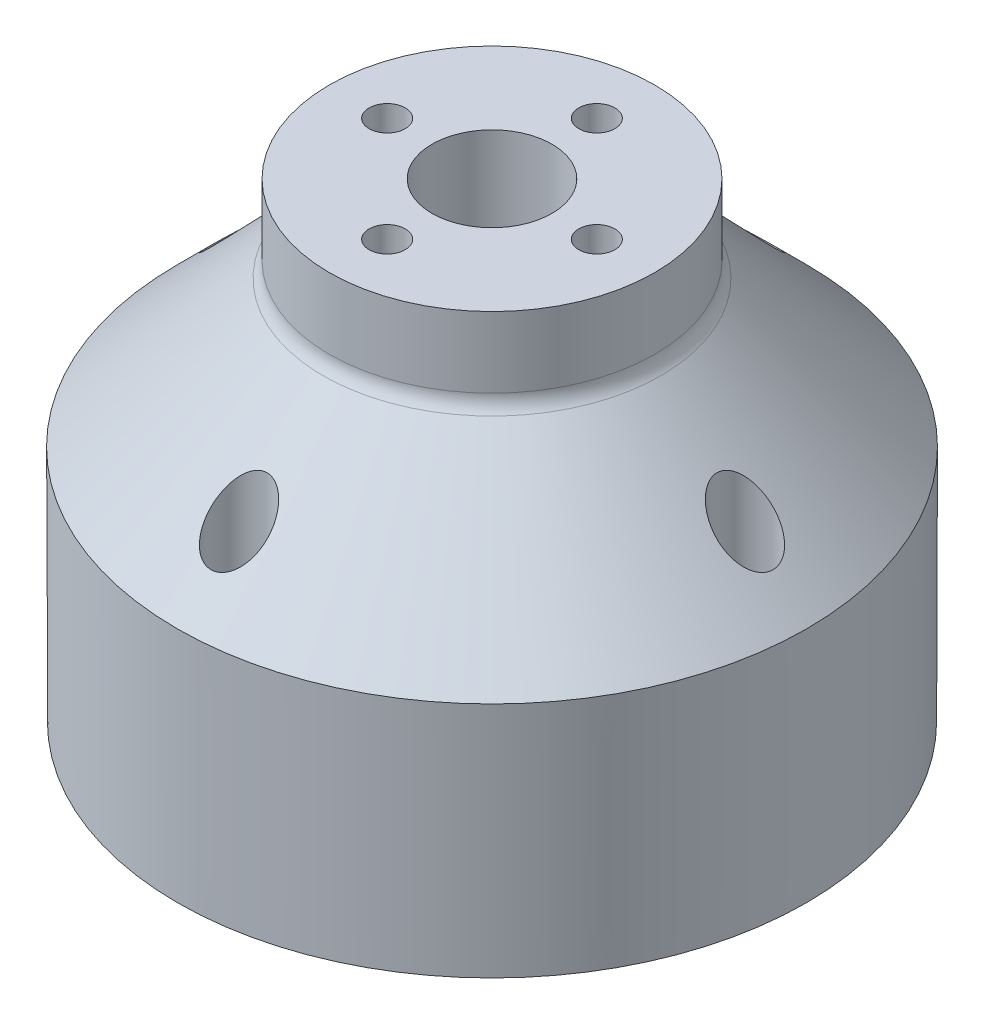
ISO-10303-21;
HEADER;
FILE_DESCRIPTION(('STEP AP214'),'2;1');
FILE_NAME('part.step','',(''),(''),'','','');
FILE_SCHEMA(('AUTOMOTIVE_DESIGN { 1 0 10303 214 1 1 1 1 }'));
ENDSEC;
DATA;
#1=APPLICATION_CONTEXT('core data for automotive mechanical design processes');
#2=APPLICATION_PROTOCOL_DEFINITION('international standard','automotive_design',2000,#1);
#3=PRODUCT_CONTEXT('',#1,'mechanical');
#4=PRODUCT('Part','Part','',(#3));
#5=PRODUCT_RELATED_PRODUCT_CATEGORY('part','',(#4));
#6=PRODUCT_DEFINITION_FORMATION('','',#4);
#7=PRODUCT_DEFINITION_CONTEXT('part definition',#1,'design');
#8=PRODUCT_DEFINITION('design','',#6,#7);
#9=PRODUCT_DEFINITION_SHAPE('','',#8);
#10=(LENGTH_UNIT() NAMED_UNIT(*) SI_UNIT(.MILLI.,.METRE.));
#11=(NAMED_UNIT(*) PLANE_ANGLE_UNIT() SI_UNIT($,.RADIAN.));
#12=(NAMED_UNIT(*) SI_UNIT($,.STERADIAN.) SOLID_ANGLE_UNIT());
#13=UNCERTAINTY_MEASURE_WITH_UNIT(LENGTH_MEASURE(1.E-05),#10,'distance_accuracy_value','');
#14=(GEOMETRIC_REPRESENTATION_CONTEXT(3) GLOBAL_UNCERTAINTY_ASSIGNED_CONTEXT((#13)) GLOBAL_UNIT_ASSIGNED_CONTEXT((#10,
#11,#12)) REPRESENTATION_CONTEXT('',''));
#15=CARTESIAN_POINT('',(0.,0.,0.));
#16=DIRECTION('',(0.,0.,1.));
#17=DIRECTION('',(1.,0.,0.));
#18=AXIS2_PLACEMENT_3D('',#15,#16,#17);
#19=CARTESIAN_POINT('',(0.,59.95,0.));
#20=DIRECTION('',(0.,1.,0.));
#21=DIRECTION('',(0.,0.,1.));
#22=AXIS2_PLACEMENT_3D('',#19,#20,#21);
#23=CONICAL_SURFACE('',#22,43.65,0.00250207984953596);
#24=CARTESIAN_POINT('',(0.,0.,0.));
#25=DIRECTION('',(0.,-1.,0.));
#26=DIRECTION('',(0.,0.,-1.));
#27=AXIS2_PLACEMENT_3D('',#24,#25,#26);
#28=CIRCLE('',#27,43.5);
#29=CARTESIAN_POINT('',(0.,0.,-43.5));
#30=VERTEX_POINT('',#29);
#31=EDGE_CURVE('E178',#30,#30,#28,.T.);
#32=ORIENTED_EDGE('',*,*,#31,.F.);
#33=EDGE_LOOP('',(#32));
#34=FACE_BOUND('',#33,.T.);
#35=CARTESIAN_POINT('',(0.,32.8888956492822,0.));
#36=DIRECTION('',(0.,-1.,0.));
#37=DIRECTION('',(0.,0.,-1.));
#38=AXIS2_PLACEMENT_3D('',#35,#36,#37);
#39=CIRCLE('',#38,43.5822908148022);
#40=CARTESIAN_POINT('',(0.,32.8888956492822,-43.5822908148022));
#41=VERTEX_POINT('',#40);
#42=EDGE_CURVE('E230',#41,#41,#39,.T.);
#43=ORIENTED_EDGE('',*,*,#42,.T.);
#44=EDGE_LOOP('',(#43));
#45=FACE_BOUND('',#44,.T.);
#46=ADVANCED_FACE('F31',(#34,#45),#23,.T.);
#47=CARTESIAN_POINT('',(-9.90473566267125E-13,61.,35.));
#48=DIRECTION('',(0.,-1.,0.));
#49=DIRECTION('',(0.,0.,-1.));
#50=AXIS2_PLACEMENT_3D('',#47,#48,#49);
#51=CYLINDRICAL_SURFACE('',#50,3.875);
#52=CARTESIAN_POINT('',(-9.90473566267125E-13,1.50000000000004,35.));
#53=DIRECTION('',(0.,1.,0.));
#54=DIRECTION('',(0.,0.,1.));
#55=AXIS2_PLACEMENT_3D('',#52,#53,#54);
#56=CIRCLE('',#55,3.875);
#57=CARTESIAN_POINT('',(-9.90473566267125E-13,1.50000000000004,31.125));
#58=VERTEX_POINT('',#57);
#59=EDGE_CURVE('E147',#58,#58,#56,.F.);
#60=ORIENTED_EDGE('',*,*,#59,.T.);
#61=EDGE_LOOP('',(#60));
#62=FACE_BOUND('',#61,.T.);
#63=CARTESIAN_POINT('',(-2.06841065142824,38.1385582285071,38.276782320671));
#64=CARTESIAN_POINT('',(-2.16932018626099,38.1967198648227,38.2130827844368));
#65=CARTESIAN_POINT('',(-2.26585182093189,38.2584439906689,38.1456268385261));
#66=CARTESIAN_POINT('',(-2.44994652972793,38.3879481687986,38.0044744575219));
#67=CARTESIAN_POINT('',(-2.53750164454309,38.4557334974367,37.9307725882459));
#68=CARTESIAN_POINT('',(-2.70396755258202,38.5966960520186,37.777948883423));
#69=CARTESIAN_POINT('',(-2.78283970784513,38.6698951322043,37.6988051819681));
#70=CARTESIAN_POINT('',(-2.9316247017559,38.8205624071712,37.5364022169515));
#71=CARTESIAN_POINT('',(-3.00153868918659,38.8980300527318,37.4531434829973));
#72=CARTESIAN_POINT('',(-3.23390606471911,39.1789685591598,37.152193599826));
#73=CARTESIAN_POINT('',(-3.3728081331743,39.3925291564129,36.9251853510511));
#74=CARTESIAN_POINT('',(-3.54198299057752,39.7232290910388,36.5769200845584));
#75=CARTESIAN_POINT('',(-3.59185362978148,39.8352227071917,36.4595045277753));
#76=CARTESIAN_POINT('',(-3.67917096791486,40.0620705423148,36.2227895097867));
#77=CARTESIAN_POINT('',(-3.71661867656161,40.1769245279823,36.1034902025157));
#78=CARTESIAN_POINT('',(-3.81231514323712,40.5296439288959,35.7388989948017));
#79=CARTESIAN_POINT('',(-3.85158544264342,40.7709955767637,35.4918403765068));
#80=CARTESIAN_POINT('',(-3.88287945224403,41.2578584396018,34.9986215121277));
#81=CARTESIAN_POINT('',(-3.87486158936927,41.5033731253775,34.7524622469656));
#82=CARTESIAN_POINT('',(-3.82485243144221,41.8980549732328,34.3609052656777));
#83=CARTESIAN_POINT('',(-3.79735222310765,42.0474029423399,34.2137011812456));
#84=CARTESIAN_POINT('',(-3.72514269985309,42.3449902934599,33.9222789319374));
#85=CARTESIAN_POINT('',(-3.68042851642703,42.4932293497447,33.7780616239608));
#86=CARTESIAN_POINT('',(-3.57353505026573,42.7872714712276,33.4938414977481));
#87=CARTESIAN_POINT('',(-3.51136685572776,42.9330760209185,33.353836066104));
#88=CARTESIAN_POINT('',(-3.36902555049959,43.2208399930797,33.0792744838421));
#89=CARTESIAN_POINT('',(-3.28886199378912,43.3628014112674,32.944715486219));
#90=CARTESIAN_POINT('',(-3.08329851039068,43.6821444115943,32.6439042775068));
#91=CARTESIAN_POINT('',(-2.95152777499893,43.8576774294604,32.4799566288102));
#92=CARTESIAN_POINT('',(-2.65403368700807,44.1937778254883,32.1683912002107));
#93=CARTESIAN_POINT('',(-2.48837022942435,44.3543708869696,32.0207453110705));
#94=CARTESIAN_POINT('',(-2.16907661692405,44.6129618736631,31.7845532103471));
#95=CARTESIAN_POINT('',(-2.02376076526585,44.7163083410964,31.6906813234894));
#96=CARTESIAN_POINT('',(-1.71302885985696,44.9053249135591,31.5197013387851));
#97=CARTESIAN_POINT('',(-1.54764185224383,44.9910200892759,31.4425694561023));
#98=CARTESIAN_POINT('',(-1.2344861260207,45.1232506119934,31.3239142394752));
#99=CARTESIAN_POINT('',(-1.09015123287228,45.1742196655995,31.2783253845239));
#100=CARTESIAN_POINT('',(-0.792125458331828,45.2577553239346,31.2037271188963));
#101=CARTESIAN_POINT('',(-0.638442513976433,45.2903373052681,31.1747038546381));
#102=CARTESIAN_POINT('',(-0.324732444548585,45.3345069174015,31.1353810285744));
#103=CARTESIAN_POINT('',(-0.164673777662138,45.3459720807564,31.1251906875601));
#104=CARTESIAN_POINT('',(0.155492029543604,45.3463947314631,31.124814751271));
#105=CARTESIAN_POINT('',(0.315599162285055,45.3353547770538,31.1346268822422));
#106=CARTESIAN_POINT('',(0.616417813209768,45.2938148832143,31.1716073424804));
#107=CARTESIAN_POINT('',(0.757591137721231,45.2651253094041,31.1971612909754));
#108=CARTESIAN_POINT('',(1.03235693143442,45.1920682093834,31.2623754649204));
#109=CARTESIAN_POINT('',(1.16594626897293,45.1476942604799,31.3020414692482));
#110=CARTESIAN_POINT('',(1.4736371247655,45.0260036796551,31.4111278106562));
#111=CARTESIAN_POINT('',(1.64334770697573,44.9425854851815,31.4861213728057));
#112=CARTESIAN_POINT('',(1.9624997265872,44.7569641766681,31.6538228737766));
#113=CARTESIAN_POINT('',(2.11189680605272,44.654721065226,31.7465685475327));
#114=CARTESIAN_POINT('',(2.44949165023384,44.3905570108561,31.9875331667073));
#115=CARTESIAN_POINT('',(2.62736743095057,44.2216875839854,32.1426215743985));
#116=CARTESIAN_POINT('',(2.8653758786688,43.9559530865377,32.3888108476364));
#117=CARTESIAN_POINT('',(2.93998561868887,43.8651830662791,32.4732463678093));
#118=CARTESIAN_POINT('',(3.08004376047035,43.6802699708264,32.6460009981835));
#119=CARTESIAN_POINT('',(3.14549223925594,43.5861269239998,32.7343200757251));
#120=CARTESIAN_POINT('',(3.29068853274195,43.3590462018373,32.9482983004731));
#121=CARTESIAN_POINT('',(3.36644788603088,43.224934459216,33.075417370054));
#122=CARTESIAN_POINT('',(3.50187663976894,42.9532834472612,33.3345104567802));
#123=CARTESIAN_POINT('',(3.56154022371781,42.815742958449,33.4664862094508));
#124=CARTESIAN_POINT('',(3.66527682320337,42.5383755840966,33.7342968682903));
#125=CARTESIAN_POINT('',(3.70933871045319,42.3985471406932,33.8701344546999));
#126=CARTESIAN_POINT('',(3.78208223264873,42.1177254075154,34.1446420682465));
#127=CARTESIAN_POINT('',(3.81076564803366,41.976732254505,34.2833117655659));
#128=CARTESIAN_POINT('',(3.85318823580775,41.6920500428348,34.5650300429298));
#129=CARTESIAN_POINT('',(3.86666519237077,41.5483558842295,34.7081129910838));
#130=CARTESIAN_POINT('',(3.87766459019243,41.2615300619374,34.9954815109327));
#131=CARTESIAN_POINT('',(3.87518543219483,41.1183984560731,35.139767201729));
#132=CARTESIAN_POINT('',(3.85395156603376,40.8336822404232,35.4285120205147));
#133=CARTESIAN_POINT('',(3.8352076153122,40.6920966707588,35.5729709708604));
#134=CARTESIAN_POINT('',(3.78096580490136,40.4113956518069,35.8610452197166));
#135=CARTESIAN_POINT('',(3.74547197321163,40.2722796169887,36.004660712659));
#136=CARTESIAN_POINT('',(3.63086384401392,39.9161236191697,36.3744186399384));
#137=CARTESIAN_POINT('',(3.53836607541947,39.7016790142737,36.5991140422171));
#138=CARTESIAN_POINT('',(3.3057429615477,39.2872904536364,37.0369101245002));
#139=CARTESIAN_POINT('',(3.16568450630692,39.0873266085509,37.2500266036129));
#140=CARTESIAN_POINT('',(2.87658132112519,38.7579297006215,37.6036318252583));
#141=CARTESIAN_POINT('',(2.7389469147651,38.6235184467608,37.7487775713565));
#142=CARTESIAN_POINT('',(2.43418365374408,38.3717450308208,38.0219433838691));
#143=CARTESIAN_POINT('',(2.26709632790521,38.2543592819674,38.1499871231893));
#144=CARTESIAN_POINT('',(1.94083795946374,38.0641101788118,38.3582960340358));
#145=CARTESIAN_POINT('',(1.78699367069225,37.9870487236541,38.4429802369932));
#146=CARTESIAN_POINT('',(1.54382038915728,37.8850668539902,38.5553120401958));
#147=CARTESIAN_POINT('',(1.46066434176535,37.8533327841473,38.5903163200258));
#148=CARTESIAN_POINT('',(1.2905939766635,37.794848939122,38.6548943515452));
#149=CARTESIAN_POINT('',(1.2036813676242,37.7680969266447,38.684470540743));
#150=CARTESIAN_POINT('',(1.02582635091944,37.7197966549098,38.7379142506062));
#151=CARTESIAN_POINT('',(0.934855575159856,37.6982954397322,38.7617301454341));
#152=CARTESIAN_POINT('',(0.750312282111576,37.6612043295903,38.8028391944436));
#153=CARTESIAN_POINT('',(0.656741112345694,37.6456114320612,38.820135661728));
#154=CARTESIAN_POINT('',(0.467805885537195,37.6206423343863,38.8478428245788));
#155=CARTESIAN_POINT('',(0.372442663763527,37.6112633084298,38.8582566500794));
#156=CARTESIAN_POINT('',(0.180798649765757,37.5989128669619,38.8719712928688));
#157=CARTESIAN_POINT('',(0.0845179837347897,37.5959405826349,38.8752730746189));
#158=CARTESIAN_POINT('',(-0.0953558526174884,37.5964299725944,38.8747295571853));
#159=CARTESIAN_POINT('',(-0.178956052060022,37.5990985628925,38.871765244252));
#160=CARTESIAN_POINT('',(-0.345523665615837,37.6092723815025,38.8604673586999));
#161=CARTESIAN_POINT('',(-0.428490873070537,37.6167791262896,38.8521321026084));
#162=CARTESIAN_POINT('',(-0.593155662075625,37.6365105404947,38.8302333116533));
#163=CARTESIAN_POINT('',(-0.674853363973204,37.6487347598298,38.8166702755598));
#164=CARTESIAN_POINT('',(-0.836453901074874,37.6777092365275,38.7845434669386));
#165=CARTESIAN_POINT('',(-0.916356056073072,37.6944611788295,38.7659778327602));
#166=CARTESIAN_POINT('',(-1.15088288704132,37.750747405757,38.7036480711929));
#167=CARTESIAN_POINT('',(-1.30225178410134,37.7965509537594,38.6529851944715));
#168=CARTESIAN_POINT('',(-1.59298873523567,37.9026569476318,38.5359008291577));
#169=CARTESIAN_POINT('',(-1.73236930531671,37.9629440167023,38.469496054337));
#170=CARTESIAN_POINT('',(-1.93468364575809,38.0640792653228,38.3584148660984));
#171=CARTESIAN_POINT('',(-2.0024815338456,38.10055839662,38.3184003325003));
#172=CARTESIAN_POINT('',(-2.06841065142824,38.1385582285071,38.276782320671));
#173=B_SPLINE_CURVE_WITH_KNOTS('',3,(#63,#64,#65,#66,#67,#68,#69,#70,#71,#72,#73,#74,#75,#76,
#77,#78,#79,#80,#81,#82,#83,#84,#85,#86,#87,#88,#89,#90,#91,#92,#93,#94,#95,#96,#97,#98,#99,
#100,#101,#102,#103,#104,#105,#106,#107,#108,#109,#110,#111,#112,#113,#114,#115,#116,#117,#118,
#119,#120,#121,#122,#123,#124,#125,#126,#127,#128,#129,#130,#131,#132,#133,#134,#135,#136,#137,
#138,#139,#140,#141,#142,#143,#144,#145,#146,#147,#148,#149,#150,#151,#152,#153,#154,#155,#156,
#157,#158,#159,#160,#161,#162,#163,#164,#165,#166,#167,#168,#169,#170,#171,#172),.UNSPECIFIED.,
.T.,.F.,(4,2,2,2,2,2,2,2,2,2,2,2,2,2,2,2,2,2,2,2,2,2,2,2,2,2,2,2,2,2,2,2,2,2,2,2,2,2,2,2,2,2,2,
2,2,2,2,2,2,2,2,2,2,2,4),(0.,0.39817581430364,0.796701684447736,1.19693478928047,
1.59711651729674,2.61440484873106,3.12334268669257,3.63223914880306,4.67135040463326,
5.71137532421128,6.34522358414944,6.97925124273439,7.61287702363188,8.24616719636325,
9.06553280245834,9.88346274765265,10.4860563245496,11.0877880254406,11.5650305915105,
12.0418734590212,12.5214731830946,13.0010183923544,13.4380860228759,13.8753328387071,
14.4822216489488,15.0904151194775,15.955896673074,16.3897131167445,16.8235259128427,
17.4218375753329,18.0203651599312,18.6193188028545,19.2182030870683,19.8272636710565,
20.4363853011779,21.0451043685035,21.6536771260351,22.622322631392,23.5896114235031,
24.3101030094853,25.0295867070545,25.6024370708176,25.8890578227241,26.1755495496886,
26.4645209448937,26.7533452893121,27.0420381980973,27.3306919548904,27.581468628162,
27.8323239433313,28.0831553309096,28.3340801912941,28.8301301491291,29.3256557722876,
29.5858034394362),.UNSPECIFIED.);
#174=CARTESIAN_POINT('',(-2.06841065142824,38.1385582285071,38.276782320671));
#175=VERTEX_POINT('',#174);
#176=EDGE_CURVE('E82',#175,#175,#173,.T.);
#177=ORIENTED_EDGE('',*,*,#176,.F.);
#178=EDGE_LOOP('',(#177));
#179=FACE_BOUND('',#178,.T.);
#180=ADVANCED_FACE('F91',(#62,#179),#51,.F.);
#181=CARTESIAN_POINT('',(35.,61.,9.92261828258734E-13));
#182=DIRECTION('',(0.,-1.,0.));
#183=DIRECTION('',(0.,0.,-1.));
#184=AXIS2_PLACEMENT_3D('',#181,#182,#183);
#185=CYLINDRICAL_SURFACE('',#184,3.875);
#186=CARTESIAN_POINT('',(35.,1.50000000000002,9.92261828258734E-13));
#187=DIRECTION('',(0.,1.,0.));
#188=DIRECTION('',(0.,0.,1.));
#189=AXIS2_PLACEMENT_3D('',#186,#187,#188);
#190=CIRCLE('',#189,3.875);
#191=CARTESIAN_POINT('',(35.,1.50000000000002,3.87500000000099));
#192=VERTEX_POINT('',#191);
#193=EDGE_CURVE('E154',#192,#192,#190,.F.);
#194=ORIENTED_EDGE('',*,*,#193,.T.);
#195=EDGE_LOOP('',(#194));
#196=FACE_BOUND('',#195,.T.);
#197=CARTESIAN_POINT('',(38.2767823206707,38.1385582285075,-2.06841065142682));
#198=CARTESIAN_POINT('',(38.3644115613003,38.0585475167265,-1.92958687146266));
#199=CARTESIAN_POINT('',(38.4450048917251,37.9852127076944,-1.78236022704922));
#200=CARTESIAN_POINT('',(38.5883538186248,37.8550673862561,-1.47253844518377));
#201=CARTESIAN_POINT('',(38.6511197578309,37.7982472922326,-1.3099522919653));
#202=CARTESIAN_POINT('',(38.7292665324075,37.7276084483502,-1.05647375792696));
#203=CARTESIAN_POINT('',(38.7527106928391,37.7064381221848,-0.970009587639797));
#204=CARTESIAN_POINT('',(38.7937233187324,37.6694261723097,-0.794596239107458));
#205=CARTESIAN_POINT('',(38.8112944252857,37.65358215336,-0.705648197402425));
#206=CARTESIAN_POINT('',(38.8402186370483,37.6275113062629,-0.525955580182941));
#207=CARTESIAN_POINT('',(38.8515730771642,37.6172832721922,-0.43521139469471));
#208=CARTESIAN_POINT('',(38.8678376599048,37.6026347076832,-0.252682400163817));
#209=CARTESIAN_POINT('',(38.8727483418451,37.5982136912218,-0.160897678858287));
#210=CARTESIAN_POINT('',(38.87588133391,37.5953929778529,0.0149509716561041));
#211=CARTESIAN_POINT('',(38.8746438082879,37.5965069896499,0.0989982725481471));
#212=CARTESIAN_POINT('',(38.866725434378,37.6036367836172,0.266654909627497));
#213=CARTESIAN_POINT('',(38.8600427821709,37.6096541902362,0.350264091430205));
#214=CARTESIAN_POINT('',(38.8413506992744,37.6264925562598,0.516360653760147));
#215=CARTESIAN_POINT('',(38.8293435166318,37.6373114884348,0.598848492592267));
#216=CARTESIAN_POINT('',(38.8002113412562,37.6635765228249,0.762177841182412));
#217=CARTESIAN_POINT('',(38.7830843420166,37.6790244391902,0.843018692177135));
#218=CARTESIAN_POINT('',(38.7252135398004,37.7312615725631,1.078981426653));
#219=CARTESIAN_POINT('',(38.6775587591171,37.7743223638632,1.23111224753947));
#220=CARTESIAN_POINT('',(38.5661815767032,37.8751909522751,1.52401497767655));
#221=CARTESIAN_POINT('',(38.5024523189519,37.9330050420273,1.66478200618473));
#222=CARTESIAN_POINT('',(38.3343436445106,38.0859350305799,1.98544200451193));
#223=CARTESIAN_POINT('',(38.2237812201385,38.1868245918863,2.15936257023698));
#224=CARTESIAN_POINT('',(37.9837639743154,38.4068821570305,2.48056019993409));
#225=CARTESIAN_POINT('',(37.8542732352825,38.526084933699,2.62778539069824));
#226=CARTESIAN_POINT('',(37.5362833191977,38.8203744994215,2.94074218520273));
#227=CARTESIAN_POINT('',(37.3425601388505,39.0007947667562,3.09611727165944));
#228=CARTESIAN_POINT('',(36.9409567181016,39.3778144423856,3.36251909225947));
#229=CARTESIAN_POINT('',(36.7330567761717,39.5744364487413,3.47348257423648));
#230=CARTESIAN_POINT('',(36.3834411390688,39.9078996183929,3.62273804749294));
#231=CARTESIAN_POINT('',(36.2437983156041,40.0418039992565,3.67288572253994));
#232=CARTESIAN_POINT('',(35.9626376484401,40.3129423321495,3.75639017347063));
#233=CARTESIAN_POINT('',(35.8211192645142,40.4501772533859,3.78974199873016));
#234=CARTESIAN_POINT('',(35.5373163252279,40.7269987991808,3.84027456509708));
#235=CARTESIAN_POINT('',(35.395031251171,40.8665872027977,3.85744245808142));
#236=CARTESIAN_POINT('',(35.1107929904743,41.1471039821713,3.87603294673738));
#237=CARTESIAN_POINT('',(34.9688397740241,41.2880322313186,3.87745701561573));
#238=CARTESIAN_POINT('',(34.684246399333,41.5722847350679,3.86477485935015));
#239=CARTESIAN_POINT('',(34.5416224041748,41.7156158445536,3.85046087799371));
#240=CARTESIAN_POINT('',(34.2584658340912,42.0019432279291,3.80608610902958));
#241=CARTESIAN_POINT('',(34.1179334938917,42.1449394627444,3.7760235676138));
#242=CARTESIAN_POINT('',(33.8399439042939,42.429565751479,3.70008740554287));
#243=CARTESIAN_POINT('',(33.702484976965,42.5711965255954,3.65422264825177));
#244=CARTESIAN_POINT('',(33.4315492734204,42.8520880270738,3.54638429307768));
#245=CARTESIAN_POINT('',(33.2980713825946,42.991349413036,3.48441525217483));
#246=CARTESIAN_POINT('',(33.0679017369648,43.2329612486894,3.36084905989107));
#247=CARTESIAN_POINT('',(32.9701219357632,43.336091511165,3.30278808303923));
#248=CARTESIAN_POINT('',(32.7780501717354,43.5395984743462,3.17675353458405));
#249=CARTESIAN_POINT('',(32.6837591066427,43.6399744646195,3.10877743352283));
#250=CARTESIAN_POINT('',(32.4995349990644,43.8369596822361,2.96261815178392));
#251=CARTESIAN_POINT('',(32.409596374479,43.9335737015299,2.88444854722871));
#252=CARTESIAN_POINT('',(32.2348948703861,44.1220419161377,2.71742845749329));
#253=CARTESIAN_POINT('',(32.1501298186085,44.2138981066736,2.62858250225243));
#254=CARTESIAN_POINT('',(31.9540651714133,44.4272226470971,2.40177523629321));
#255=CARTESIAN_POINT('',(31.8457490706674,44.5458017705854,2.25840173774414));
#256=CARTESIAN_POINT('',(31.6456715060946,44.76590731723,1.94884131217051));
#257=CARTESIAN_POINT('',(31.5538852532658,44.8674592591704,1.78268921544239));
#258=CARTESIAN_POINT('',(31.4103614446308,45.0268573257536,1.46732392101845));
#259=CARTESIAN_POINT('',(31.3542566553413,45.0894012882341,1.32253759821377));
#260=CARTESIAN_POINT('',(31.2825677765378,45.1694919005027,1.0966245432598));
#261=CARTESIAN_POINT('',(31.2607466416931,45.1939044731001,1.01984953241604));
#262=CARTESIAN_POINT('',(31.221641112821,45.2376950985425,0.863765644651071));
#263=CARTESIAN_POINT('',(31.2043546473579,45.2570754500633,0.784457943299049));
#264=CARTESIAN_POINT('',(31.1745370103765,45.2905274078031,0.62309601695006));
#265=CARTESIAN_POINT('',(31.1620488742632,45.3045509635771,0.541023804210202));
#266=CARTESIAN_POINT('',(31.1423362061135,45.3266960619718,0.375497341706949));
#267=CARTESIAN_POINT('',(31.1351091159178,45.3348204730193,0.292043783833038));
#268=CARTESIAN_POINT('',(31.1260922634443,45.3449578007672,0.124484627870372));
#269=CARTESIAN_POINT('',(31.124301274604,45.3469720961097,0.0403791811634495));
#270=CARTESIAN_POINT('',(31.1261902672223,45.3448480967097,-0.127664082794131));
#271=CARTESIAN_POINT('',(31.1298697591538,45.3407103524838,-0.211601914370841));
#272=CARTESIAN_POINT('',(31.1474138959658,45.3209892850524,-0.441094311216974));
#273=CARTESIAN_POINT('',(31.1668392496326,45.299158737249,-0.585762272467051));
#274=CARTESIAN_POINT('',(31.2208181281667,45.2386107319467,-0.868452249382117));
#275=CARTESIAN_POINT('',(31.2553778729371,45.1998863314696,-1.00647150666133));
#276=CARTESIAN_POINT('',(31.3502405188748,45.0938692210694,-1.31461599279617));
#277=CARTESIAN_POINT('',(31.4151929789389,45.0214519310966,-1.48154696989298));
#278=CARTESIAN_POINT('',(31.5626303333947,44.8577957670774,-1.79740639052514));
#279=CARTESIAN_POINT('',(31.6451479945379,44.7665217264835,-1.94630036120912));
#280=CARTESIAN_POINT('',(31.8599621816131,44.5301175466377,-2.28258270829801));
#281=CARTESIAN_POINT('',(31.9988525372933,44.3781841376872,-2.46098749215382));
#282=CARTESIAN_POINT('',(32.220769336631,44.1373641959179,-2.702498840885));
#283=CARTESIAN_POINT('',(32.297117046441,44.0548177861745,-2.77873823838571));
#284=CARTESIAN_POINT('',(32.4536945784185,43.8862003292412,-2.92288621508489));
#285=CARTESIAN_POINT('',(32.5339234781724,43.8001301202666,-2.99079676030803));
#286=CARTESIAN_POINT('',(32.7310916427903,43.5894710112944,-3.14469234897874));
#287=CARTESIAN_POINT('',(32.8496415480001,43.4635072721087,-3.22673159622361));
#288=CARTESIAN_POINT('',(33.0919044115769,43.2076129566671,-3.3756506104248));
#289=CARTESIAN_POINT('',(33.2156193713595,43.077680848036,-3.44252443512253));
#290=CARTESIAN_POINT('',(33.4672154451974,42.815013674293,-3.56168252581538));
#291=CARTESIAN_POINT('',(33.5950995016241,42.6822766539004,-3.61395622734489));
#292=CARTESIAN_POINT('',(33.8540395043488,42.4151114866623,-3.70421350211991));
#293=CARTESIAN_POINT('',(33.9850950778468,42.2806835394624,-3.74219874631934));
#294=CARTESIAN_POINT('',(34.2526525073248,42.0078681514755,-3.80478580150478));
#295=CARTESIAN_POINT('',(34.3892103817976,41.8694604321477,-3.82906191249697));
#296=CARTESIAN_POINT('',(34.6640112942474,41.5926020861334,-3.86288912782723));
#297=CARTESIAN_POINT('',(34.8022544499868,41.454151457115,-3.87243919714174));
#298=CARTESIAN_POINT('',(35.2182652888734,41.0399863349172,-3.878770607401));
#299=CARTESIAN_POINT('',(35.4977163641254,40.7650487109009,-3.85332689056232));
#300=CARTESIAN_POINT('',(35.8985258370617,40.3751063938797,-3.77148670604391));
#301=CARTESIAN_POINT('',(36.021519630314,40.2560534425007,-3.74011725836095));
#302=CARTESIAN_POINT('',(36.2660159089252,40.0205264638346,-3.66458943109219));
#303=CARTESIAN_POINT('',(36.3875183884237,39.9040524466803,-3.62043100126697));
#304=CARTESIAN_POINT('',(36.7486760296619,39.5594626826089,-3.46785629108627));
#305=CARTESIAN_POINT('',(36.9850878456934,39.3360757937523,-3.33932009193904));
#306=CARTESIAN_POINT('',(37.3114828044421,39.0301881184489,-3.1124756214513));
#307=CARTESIAN_POINT('',(37.4095485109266,38.9386409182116,-3.0373356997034));
#308=CARTESIAN_POINT('',(37.6007472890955,38.7607661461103,-2.87531480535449));
#309=CARTESIAN_POINT('',(37.6938797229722,38.6744392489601,-2.78843231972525));
#310=CARTESIAN_POINT('',(37.873478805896,38.5084940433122,-2.60295147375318));
#311=CARTESIAN_POINT('',(37.9599654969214,38.428855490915,-2.50439081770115));
#312=CARTESIAN_POINT('',(38.1248739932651,38.277436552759,-2.29532046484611));
#313=CARTESIAN_POINT('',(38.2033017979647,38.2056503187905,-2.18481978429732));
#314=CARTESIAN_POINT('',(38.2767823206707,38.1385582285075,-2.06841065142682));
#315=B_SPLINE_CURVE_WITH_KNOTS('',3,(#197,#198,#199,#200,#201,#202,#203,#204,#205,#206,#207,
#208,#209,#210,#211,#212,#213,#214,#215,#216,#217,#218,#219,#220,#221,#222,#223,#224,#225,#226,
#227,#228,#229,#230,#231,#232,#233,#234,#235,#236,#237,#238,#239,#240,#241,#242,#243,#244,#245,
#246,#247,#248,#249,#250,#251,#252,#253,#254,#255,#256,#257,#258,#259,#260,#261,#262,#263,#264,
#265,#266,#267,#268,#269,#270,#271,#272,#273,#274,#275,#276,#277,#278,#279,#280,#281,#282,#283,
#284,#285,#286,#287,#288,#289,#290,#291,#292,#293,#294,#295,#296,#297,#298,#299,#300,#301,#302,
#303,#304,#305,#306,#307,#308,#309,#310,#311,#312,#313,#314),.UNSPECIFIED.,.T.,.F.,(4,2,2,2,2,2,
2,2,2,2,2,2,2,2,2,2,2,2,2,2,2,2,2,2,2,2,2,2,2,2,2,2,2,2,2,2,2,2,2,2,2,2,2,2,2,2,2,2,2,2,2,2,2,2,
2,2,2,2,4),(0.,0.547505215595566,1.09469213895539,1.37053832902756,1.64626030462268,
1.92192305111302,2.19756272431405,2.44943682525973,2.70139440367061,2.95324570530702,
3.20519583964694,3.69838745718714,4.19178978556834,4.87636194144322,5.56225039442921,
6.47820071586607,7.39545095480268,7.99434747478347,8.59342041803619,9.19296855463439,
9.79246058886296,10.399962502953,11.0075320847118,11.6147614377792,12.2218191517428,
12.6820300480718,13.1423585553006,13.6020801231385,14.061607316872,14.7053332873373,
15.3480857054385,15.8481621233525,16.0982932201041,16.3483098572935,16.6005192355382,
16.8526058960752,17.1046356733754,17.3566428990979,17.7972002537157,18.2379388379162,
18.8143401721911,19.391826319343,20.2042562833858,20.6115686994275,21.0187847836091,
21.5923142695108,22.1660680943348,22.7402360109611,23.3143367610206,23.9015578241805,
24.4888201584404,25.6616159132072,26.1832932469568,26.7049726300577,27.7478862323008,
28.2087252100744,28.6696236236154,29.1290725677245,29.588176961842),.UNSPECIFIED.);
#316=CARTESIAN_POINT('',(38.2767823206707,38.1385582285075,-2.06841065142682));
#317=VERTEX_POINT('',#316);
#318=EDGE_CURVE('E78',#317,#317,#315,.T.);
#319=ORIENTED_EDGE('',*,*,#318,.F.);
#320=EDGE_LOOP('',(#319));
#321=FACE_BOUND('',#320,.T.);
#322=ADVANCED_FACE('F87',(#196,#321),#185,.F.);
#323=CARTESIAN_POINT('',(9.90473566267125E-13,61.,-35.));
#324=DIRECTION('',(0.,-1.,0.));
#325=DIRECTION('',(0.,0.,-1.));
#326=AXIS2_PLACEMENT_3D('',#323,#324,#325);
#327=CYLINDRICAL_SURFACE('',#326,3.875);
#328=CARTESIAN_POINT('',(9.90473566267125E-13,1.50000000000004,-35.));
#329=DIRECTION('',(0.,1.,0.));
#330=DIRECTION('',(0.,0.,1.));
#331=AXIS2_PLACEMENT_3D('',#328,#329,#330);
#332=CIRCLE('',#331,3.875);
#333=CARTESIAN_POINT('',(9.90473566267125E-13,1.50000000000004,-38.875));
#334=VERTEX_POINT('',#333);
#335=EDGE_CURVE('E157',#334,#334,#332,.F.);
#336=ORIENTED_EDGE('',*,*,#335,.T.);
#337=EDGE_LOOP('',(#336));
#338=FACE_BOUND('',#337,.T.);
#339=CARTESIAN_POINT('',(-2.0684106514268,38.1385582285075,-38.2767823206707));
#340=CARTESIAN_POINT('',(-1.92958687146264,38.0585475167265,-38.3644115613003));
#341=CARTESIAN_POINT('',(-1.78236022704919,37.9852127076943,-38.4450048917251));
#342=CARTESIAN_POINT('',(-1.47253844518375,37.8550673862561,-38.5883538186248));
#343=CARTESIAN_POINT('',(-1.30995229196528,37.7982472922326,-38.6511197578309));
#344=CARTESIAN_POINT('',(-1.05647375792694,37.7276084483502,-38.7292665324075));
#345=CARTESIAN_POINT('',(-0.970009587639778,37.7064381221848,-38.7527106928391));
#346=CARTESIAN_POINT('',(-0.794596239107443,37.6694261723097,-38.7937233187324));
#347=CARTESIAN_POINT('',(-0.70564819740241,37.65358215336,-38.8112944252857));
#348=CARTESIAN_POINT('',(-0.525955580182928,37.6275113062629,-38.8402186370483));
#349=CARTESIAN_POINT('',(-0.435211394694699,37.6172832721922,-38.8515730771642));
#350=CARTESIAN_POINT('',(-0.252682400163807,37.6026347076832,-38.8678376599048));
#351=CARTESIAN_POINT('',(-0.160897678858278,37.5982136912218,-38.8727483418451));
#352=CARTESIAN_POINT('',(0.0149509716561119,37.5953929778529,-38.87588133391));
#353=CARTESIAN_POINT('',(0.098998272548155,37.5965069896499,-38.8746438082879));
#354=CARTESIAN_POINT('',(0.266654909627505,37.6036367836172,-38.866725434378));
#355=CARTESIAN_POINT('',(0.350264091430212,37.6096541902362,-38.8600427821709));
#356=CARTESIAN_POINT('',(0.516360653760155,37.6264925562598,-38.8413506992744));
#357=CARTESIAN_POINT('',(0.598848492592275,37.6373114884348,-38.8293435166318));
#358=CARTESIAN_POINT('',(0.76217784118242,37.6635765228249,-38.8002113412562));
#359=CARTESIAN_POINT('',(0.843018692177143,37.6790244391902,-38.7830843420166));
#360=CARTESIAN_POINT('',(1.078981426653,37.7312615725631,-38.7252135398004));
#361=CARTESIAN_POINT('',(1.23111224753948,37.7743223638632,-38.6775587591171));
#362=CARTESIAN_POINT('',(1.52401497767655,37.8751909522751,-38.5661815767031));
#363=CARTESIAN_POINT('',(1.66478200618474,37.9330050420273,-38.5024523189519));
#364=CARTESIAN_POINT('',(1.98544200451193,38.0859350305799,-38.3343436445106));
#365=CARTESIAN_POINT('',(2.15936257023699,38.1868245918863,-38.2237812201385));
#366=CARTESIAN_POINT('',(2.4805601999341,38.4068821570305,-37.9837639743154));
#367=CARTESIAN_POINT('',(2.62778539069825,38.526084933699,-37.8542732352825));
#368=CARTESIAN_POINT('',(2.94074218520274,38.8203744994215,-37.5362833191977));
#369=CARTESIAN_POINT('',(3.09611727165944,39.0007947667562,-37.3425601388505));
#370=CARTESIAN_POINT('',(3.36251909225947,39.3778144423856,-36.9409567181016));
#371=CARTESIAN_POINT('',(3.47348257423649,39.5744364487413,-36.7330567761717));
#372=CARTESIAN_POINT('',(3.62273804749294,39.9078996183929,-36.3834411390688));
#373=CARTESIAN_POINT('',(3.67288572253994,40.0418039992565,-36.2437983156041));
#374=CARTESIAN_POINT('',(3.75639017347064,40.3129423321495,-35.9626376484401));
#375=CARTESIAN_POINT('',(3.78974199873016,40.4501772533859,-35.8211192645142));
#376=CARTESIAN_POINT('',(3.84027456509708,40.7269987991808,-35.5373163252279));
#377=CARTESIAN_POINT('',(3.85744245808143,40.8665872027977,-35.395031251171));
#378=CARTESIAN_POINT('',(3.87603294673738,41.1471039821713,-35.1107929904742));
#379=CARTESIAN_POINT('',(3.87745701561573,41.2880322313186,-34.9688397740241));
#380=CARTESIAN_POINT('',(3.86477485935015,41.572284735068,-34.6842463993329));
#381=CARTESIAN_POINT('',(3.8504608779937,41.7156158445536,-34.5416224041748));
#382=CARTESIAN_POINT('',(3.80608610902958,42.0019432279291,-34.2584658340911));
#383=CARTESIAN_POINT('',(3.77602356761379,42.1449394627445,-34.1179334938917));
#384=CARTESIAN_POINT('',(3.70008740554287,42.429565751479,-33.8399439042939));
#385=CARTESIAN_POINT('',(3.65422264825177,42.5711965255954,-33.702484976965));
#386=CARTESIAN_POINT('',(3.54638429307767,42.8520880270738,-33.4315492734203));
#387=CARTESIAN_POINT('',(3.48441525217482,42.991349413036,-33.2980713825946));
#388=CARTESIAN_POINT('',(3.36084905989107,43.2329612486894,-33.0679017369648));
#389=CARTESIAN_POINT('',(3.30278808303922,43.336091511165,-32.9701219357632));
#390=CARTESIAN_POINT('',(3.17675353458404,43.5395984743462,-32.7780501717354));
#391=CARTESIAN_POINT('',(3.10877743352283,43.6399744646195,-32.6837591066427));
#392=CARTESIAN_POINT('',(2.96261815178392,43.8369596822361,-32.4995349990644));
#393=CARTESIAN_POINT('',(2.8844485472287,43.9335737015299,-32.409596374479));
#394=CARTESIAN_POINT('',(2.71742845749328,44.1220419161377,-32.2348948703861));
#395=CARTESIAN_POINT('',(2.62858250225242,44.2138981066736,-32.1501298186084));
#396=CARTESIAN_POINT('',(2.4017752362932,44.4272226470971,-31.9540651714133));
#397=CARTESIAN_POINT('',(2.25840173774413,44.5458017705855,-31.8457490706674));
#398=CARTESIAN_POINT('',(1.94884131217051,44.76590731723,-31.6456715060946));
#399=CARTESIAN_POINT('',(1.78268921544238,44.8674592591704,-31.5538852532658));
#400=CARTESIAN_POINT('',(1.46732392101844,45.0268573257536,-31.4103614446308));
#401=CARTESIAN_POINT('',(1.32253759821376,45.0894012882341,-31.3542566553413));
#402=CARTESIAN_POINT('',(1.09662454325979,45.1694919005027,-31.2825677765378));
#403=CARTESIAN_POINT('',(1.01984953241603,45.1939044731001,-31.2607466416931));
#404=CARTESIAN_POINT('',(0.86376564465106,45.2376950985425,-31.221641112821));
#405=CARTESIAN_POINT('',(0.784457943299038,45.2570754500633,-31.2043546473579));
#406=CARTESIAN_POINT('',(0.623096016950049,45.2905274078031,-31.1745370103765));
#407=CARTESIAN_POINT('',(0.541023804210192,45.3045509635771,-31.1620488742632));
#408=CARTESIAN_POINT('',(0.375497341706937,45.3266960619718,-31.1423362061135));
#409=CARTESIAN_POINT('',(0.292043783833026,45.3348204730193,-31.1351091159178));
#410=CARTESIAN_POINT('',(0.124484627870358,45.3449578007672,-31.1260922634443));
#411=CARTESIAN_POINT('',(0.0403791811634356,45.3469720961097,-31.1243012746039));
#412=CARTESIAN_POINT('',(-0.127664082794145,45.3448480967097,-31.1261902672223));
#413=CARTESIAN_POINT('',(-0.211601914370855,45.3407103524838,-31.1298697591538));
#414=CARTESIAN_POINT('',(-0.441094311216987,45.3209892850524,-31.1474138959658));
#415=CARTESIAN_POINT('',(-0.585762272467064,45.299158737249,-31.1668392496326));
#416=CARTESIAN_POINT('',(-0.868452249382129,45.2386107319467,-31.2208181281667));
#417=CARTESIAN_POINT('',(-1.00647150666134,45.1998863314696,-31.2553778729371));
#418=CARTESIAN_POINT('',(-1.31461599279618,45.0938692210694,-31.3502405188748));
#419=CARTESIAN_POINT('',(-1.48154696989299,45.0214519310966,-31.4151929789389));
#420=CARTESIAN_POINT('',(-1.79740639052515,44.8577957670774,-31.5626303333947));
#421=CARTESIAN_POINT('',(-1.94630036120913,44.7665217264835,-31.6451479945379));
#422=CARTESIAN_POINT('',(-2.28258270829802,44.5301175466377,-31.8599621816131));
#423=CARTESIAN_POINT('',(-2.46098749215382,44.3781841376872,-31.9988525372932));
#424=CARTESIAN_POINT('',(-2.702498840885,44.1373641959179,-32.220769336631));
#425=CARTESIAN_POINT('',(-2.77873823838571,44.0548177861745,-32.297117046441));
#426=CARTESIAN_POINT('',(-2.9228862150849,43.8862003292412,-32.4536945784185));
#427=CARTESIAN_POINT('',(-2.99079676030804,43.8001301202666,-32.5339234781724));
#428=CARTESIAN_POINT('',(-3.14469234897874,43.5894710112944,-32.7310916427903));
#429=CARTESIAN_POINT('',(-3.22673159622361,43.4635072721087,-32.8496415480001));
#430=CARTESIAN_POINT('',(-3.37565061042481,43.2076129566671,-33.0919044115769));
#431=CARTESIAN_POINT('',(-3.44252443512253,43.077680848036,-33.2156193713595));
#432=CARTESIAN_POINT('',(-3.56168252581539,42.815013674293,-33.4672154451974));
#433=CARTESIAN_POINT('',(-3.6139562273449,42.6822766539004,-33.5950995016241));
#434=CARTESIAN_POINT('',(-3.70421350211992,42.4151114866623,-33.8540395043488));
#435=CARTESIAN_POINT('',(-3.74219874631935,42.2806835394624,-33.9850950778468));
#436=CARTESIAN_POINT('',(-3.80478580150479,42.0078681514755,-34.2526525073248));
#437=CARTESIAN_POINT('',(-3.82906191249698,41.8694604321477,-34.3892103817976));
#438=CARTESIAN_POINT('',(-3.86288912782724,41.5926020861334,-34.6640112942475));
#439=CARTESIAN_POINT('',(-3.87243919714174,41.454151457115,-34.8022544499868));
#440=CARTESIAN_POINT('',(-3.878770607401,41.0399863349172,-35.2182652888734));
#441=CARTESIAN_POINT('',(-3.85332689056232,40.7650487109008,-35.4977163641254));
#442=CARTESIAN_POINT('',(-3.77148670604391,40.3751063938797,-35.8985258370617));
#443=CARTESIAN_POINT('',(-3.74011725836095,40.2560534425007,-36.021519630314));
#444=CARTESIAN_POINT('',(-3.66458943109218,40.0205264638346,-36.2660159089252));
#445=CARTESIAN_POINT('',(-3.62043100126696,39.9040524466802,-36.3875183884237));
#446=CARTESIAN_POINT('',(-3.46785629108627,39.5594626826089,-36.748676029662));
#447=CARTESIAN_POINT('',(-3.33932009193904,39.3360757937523,-36.9850878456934));
#448=CARTESIAN_POINT('',(-3.11247562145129,39.0301881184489,-37.3114828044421));
#449=CARTESIAN_POINT('',(-3.03733569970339,38.9386409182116,-37.4095485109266));
#450=CARTESIAN_POINT('',(-2.87531480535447,38.7607661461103,-37.6007472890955));
#451=CARTESIAN_POINT('',(-2.78843231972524,38.6744392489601,-37.6938797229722));
#452=CARTESIAN_POINT('',(-2.60295147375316,38.5084940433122,-37.873478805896));
#453=CARTESIAN_POINT('',(-2.50439081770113,38.428855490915,-37.9599654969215));
#454=CARTESIAN_POINT('',(-2.29532046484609,38.277436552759,-38.1248739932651));
#455=CARTESIAN_POINT('',(-2.18481978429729,38.2056503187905,-38.2033017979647));
#456=CARTESIAN_POINT('',(-2.0684106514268,38.1385582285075,-38.2767823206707));
#457=B_SPLINE_CURVE_WITH_KNOTS('',3,(#339,#340,#341,#342,#343,#344,#345,#346,#347,#348,#349,
#350,#351,#352,#353,#354,#355,#356,#357,#358,#359,#360,#361,#362,#363,#364,#365,#366,#367,#368,
#369,#370,#371,#372,#373,#374,#375,#376,#377,#378,#379,#380,#381,#382,#383,#384,#385,#386,#387,
#388,#389,#390,#391,#392,#393,#394,#395,#396,#397,#398,#399,#400,#401,#402,#403,#404,#405,#406,
#407,#408,#409,#410,#411,#412,#413,#414,#415,#416,#417,#418,#419,#420,#421,#422,#423,#424,#425,
#426,#427,#428,#429,#430,#431,#432,#433,#434,#435,#436,#437,#438,#439,#440,#441,#442,#443,#444,
#445,#446,#447,#448,#449,#450,#451,#452,#453,#454,#455,#456),.UNSPECIFIED.,.T.,.F.,(4,2,2,2,2,2,
2,2,2,2,2,2,2,2,2,2,2,2,2,2,2,2,2,2,2,2,2,2,2,2,2,2,2,2,2,2,2,2,2,2,2,2,2,2,2,2,2,2,2,2,2,2,2,2,
2,2,2,2,4),(0.,0.54750521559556,1.09469213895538,1.37053832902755,1.64626030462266,
1.921923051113,2.19756272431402,2.4494368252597,2.70139440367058,2.95324570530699,
3.20519583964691,3.69838745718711,4.19178978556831,4.8763619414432,5.56225039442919,
6.47820071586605,7.39545095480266,7.99434747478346,8.59342041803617,9.19296855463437,
9.79246058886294,10.3999625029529,11.0075320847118,11.6147614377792,12.2218191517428,
12.6820300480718,13.1423585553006,13.6020801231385,14.061607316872,14.7053332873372,
15.3480857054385,15.8481621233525,16.0982932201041,16.3483098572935,16.6005192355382,
16.8526058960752,17.1046356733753,17.3566428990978,17.7972002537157,18.2379388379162,
18.8143401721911,19.391826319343,20.2042562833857,20.6115686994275,21.0187847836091,
21.5923142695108,22.1660680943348,22.7402360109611,23.3143367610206,23.9015578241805,
24.4888201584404,25.6616159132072,26.1832932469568,26.7049726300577,27.7478862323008,
28.2087252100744,28.6696236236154,29.1290725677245,29.588176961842),.UNSPECIFIED.);
#458=CARTESIAN_POINT('',(-2.0684106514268,38.1385582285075,-38.2767823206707));
#459=VERTEX_POINT('',#458);
#460=EDGE_CURVE('E55',#459,#459,#457,.T.);
#461=ORIENTED_EDGE('',*,*,#460,.F.);
#462=EDGE_LOOP('',(#461));
#463=FACE_BOUND('',#462,.T.);
#464=ADVANCED_FACE('F90',(#338,#463),#327,.F.);
#465=CARTESIAN_POINT('',(-35.,61.,-9.96598636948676E-13));
#466=DIRECTION('',(0.,-1.,0.));
#467=DIRECTION('',(0.,0.,-1.));
#468=AXIS2_PLACEMENT_3D('',#465,#466,#467);
#469=CYLINDRICAL_SURFACE('',#468,3.875);
#470=CARTESIAN_POINT('',(-35.,1.49999999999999,-9.96598636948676E-13));
#471=DIRECTION('',(0.,1.,0.));
#472=DIRECTION('',(0.,0.,1.));
#473=AXIS2_PLACEMENT_3D('',#470,#471,#472);
#474=CIRCLE('',#473,3.875);
#475=CARTESIAN_POINT('',(-35.,1.49999999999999,-3.875000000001));
#476=VERTEX_POINT('',#475);
#477=EDGE_CURVE('E149',#476,#476,#474,.F.);
#478=ORIENTED_EDGE('',*,*,#477,.T.);
#479=EDGE_LOOP('',(#478));
#480=FACE_BOUND('',#479,.T.);
#481=CARTESIAN_POINT('',(-38.2767823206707,38.1385582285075,-2.06841065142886));
#482=CARTESIAN_POINT('',(-38.2130827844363,38.1967198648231,-2.16932018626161));
#483=CARTESIAN_POINT('',(-38.1456268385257,38.2584439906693,-2.26585182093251));
#484=CARTESIAN_POINT('',(-38.0044744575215,38.3879481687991,-2.44994652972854));
#485=CARTESIAN_POINT('',(-37.9307725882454,38.4557334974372,-2.53750164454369));
#486=CARTESIAN_POINT('',(-37.7779488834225,38.5966960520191,-2.7039675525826));
#487=CARTESIAN_POINT('',(-37.6988051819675,38.6698951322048,-2.7828397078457));
#488=CARTESIAN_POINT('',(-37.5364022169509,38.8205624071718,-2.93162470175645));
#489=CARTESIAN_POINT('',(-37.4531434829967,38.8980300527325,-3.00153868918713));
#490=CARTESIAN_POINT('',(-37.1521935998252,39.1789685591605,-3.23390606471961));
#491=CARTESIAN_POINT('',(-36.9251853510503,39.3925291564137,-3.37280813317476));
#492=CARTESIAN_POINT('',(-36.5769200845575,39.7232290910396,-3.54198299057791));
#493=CARTESIAN_POINT('',(-36.4595045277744,39.8352227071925,-3.59185362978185));
#494=CARTESIAN_POINT('',(-36.2227895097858,40.0620705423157,-3.67917096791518));
#495=CARTESIAN_POINT('',(-36.1034902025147,40.1769245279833,-3.7166186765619));
#496=CARTESIAN_POINT('',(-35.7388989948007,40.5296439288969,-3.81231514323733));
#497=CARTESIAN_POINT('',(-35.4918403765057,40.7709955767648,-3.85158544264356));
#498=CARTESIAN_POINT('',(-34.9986215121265,41.2578584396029,-3.88287945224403));
#499=CARTESIAN_POINT('',(-34.7524622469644,41.5033731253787,-3.8748615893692));
#500=CARTESIAN_POINT('',(-34.3609052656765,41.8980549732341,-3.824852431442));
#501=CARTESIAN_POINT('',(-34.2137011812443,42.0474029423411,-3.79735222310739));
#502=CARTESIAN_POINT('',(-33.9222789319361,42.3449902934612,-3.72514269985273));
#503=CARTESIAN_POINT('',(-33.7780616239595,42.493229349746,-3.68042851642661));
#504=CARTESIAN_POINT('',(-33.4938414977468,42.7872714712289,-3.5735350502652));
#505=CARTESIAN_POINT('',(-33.3538360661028,42.9330760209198,-3.51136685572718));
#506=CARTESIAN_POINT('',(-33.0792744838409,43.220839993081,-3.36902555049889));
#507=CARTESIAN_POINT('',(-32.9447154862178,43.3628014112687,-3.28886199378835));
#508=CARTESIAN_POINT('',(-32.6439042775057,43.6821444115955,-3.08329851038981));
#509=CARTESIAN_POINT('',(-32.4799566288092,43.8576774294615,-2.95152777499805));
#510=CARTESIAN_POINT('',(-32.1683912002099,44.1937778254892,-2.65403368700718));
#511=CARTESIAN_POINT('',(-32.0207453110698,44.3543708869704,-2.48837022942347));
#512=CARTESIAN_POINT('',(-31.7845532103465,44.6129618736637,-2.16907661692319));
#513=CARTESIAN_POINT('',(-31.6906813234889,44.7163083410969,-2.02376076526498));
#514=CARTESIAN_POINT('',(-31.5197013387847,44.9053249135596,-1.71302885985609));
#515=CARTESIAN_POINT('',(-31.4425694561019,44.9910200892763,-1.54764185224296));
#516=CARTESIAN_POINT('',(-31.3239142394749,45.1232506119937,-1.23448612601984));
#517=CARTESIAN_POINT('',(-31.2783253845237,45.1742196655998,-1.09015123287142));
#518=CARTESIAN_POINT('',(-31.2037271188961,45.2577553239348,-0.792125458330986));
#519=CARTESIAN_POINT('',(-31.1747038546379,45.2903373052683,-0.6384425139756));
#520=CARTESIAN_POINT('',(-31.1353810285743,45.3345069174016,-0.324732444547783));
#521=CARTESIAN_POINT('',(-31.12519068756,45.3459720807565,-0.164673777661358));
#522=CARTESIAN_POINT('',(-31.124814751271,45.346394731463,0.155492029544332));
#523=CARTESIAN_POINT('',(-31.1346268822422,45.3353547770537,0.315599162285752));
#524=CARTESIAN_POINT('',(-31.1716073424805,45.2938148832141,0.616417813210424));
#525=CARTESIAN_POINT('',(-31.1971612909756,45.2651253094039,0.757591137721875));
#526=CARTESIAN_POINT('',(-31.2623754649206,45.1920682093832,1.03235693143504));
#527=CARTESIAN_POINT('',(-31.3020414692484,45.1476942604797,1.16594626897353));
#528=CARTESIAN_POINT('',(-31.4111278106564,45.0260036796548,1.47363712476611));
#529=CARTESIAN_POINT('',(-31.486121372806,44.9425854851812,1.64334770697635));
#530=CARTESIAN_POINT('',(-31.653822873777,44.7569641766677,1.96249972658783));
#531=CARTESIAN_POINT('',(-31.7465685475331,44.6547210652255,2.11189680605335));
#532=CARTESIAN_POINT('',(-31.9875331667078,44.3905570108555,2.44949165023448));
#533=CARTESIAN_POINT('',(-32.1426215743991,44.2216875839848,2.6273674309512));
#534=CARTESIAN_POINT('',(-32.3888108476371,43.955953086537,2.86537587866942));
#535=CARTESIAN_POINT('',(-32.4732463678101,43.8651830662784,2.93998561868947));
#536=CARTESIAN_POINT('',(-32.6460009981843,43.6802699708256,3.08004376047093));
#537=CARTESIAN_POINT('',(-32.7343200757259,43.5861269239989,3.14549223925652));
#538=CARTESIAN_POINT('',(-32.948298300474,43.3590462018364,3.29068853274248));
#539=CARTESIAN_POINT('',(-33.0754173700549,43.2249344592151,3.36644788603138));
#540=CARTESIAN_POINT('',(-33.3345104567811,42.9532834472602,3.5018766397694));
#541=CARTESIAN_POINT('',(-33.4664862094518,42.8157429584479,3.56154022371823));
#542=CARTESIAN_POINT('',(-33.7342968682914,42.5383755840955,3.66527682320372));
#543=CARTESIAN_POINT('',(-33.870134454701,42.3985471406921,3.70933871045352));
#544=CARTESIAN_POINT('',(-34.1446420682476,42.1177254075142,3.78208223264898));
#545=CARTESIAN_POINT('',(-34.2833117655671,41.9767322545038,3.81076564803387));
#546=CARTESIAN_POINT('',(-34.565030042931,41.6920500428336,3.85318823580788));
#547=CARTESIAN_POINT('',(-34.7081129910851,41.5483558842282,3.86666519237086));
#548=CARTESIAN_POINT('',(-34.995481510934,41.2615300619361,3.87766459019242));
#549=CARTESIAN_POINT('',(-35.1397672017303,41.1183984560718,3.87518543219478));
#550=CARTESIAN_POINT('',(-35.428512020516,40.8336822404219,3.85395156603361));
#551=CARTESIAN_POINT('',(-35.5729709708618,40.6920966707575,3.83520761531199));
#552=CARTESIAN_POINT('',(-35.861045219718,40.4113956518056,3.78096580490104));
#553=CARTESIAN_POINT('',(-36.0046607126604,40.2722796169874,3.74547197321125));
#554=CARTESIAN_POINT('',(-36.3744186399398,39.9161236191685,3.63086384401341));
#555=CARTESIAN_POINT('',(-36.5991140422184,39.7016790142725,3.53836607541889));
#556=CARTESIAN_POINT('',(-37.0369101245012,39.2872904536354,3.30574296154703));
#557=CARTESIAN_POINT('',(-37.2500266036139,39.08732660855,3.16568450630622));
#558=CARTESIAN_POINT('',(-37.6036318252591,38.7579297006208,2.87658132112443));
#559=CARTESIAN_POINT('',(-37.7487775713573,38.6235184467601,2.73894691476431));
#560=CARTESIAN_POINT('',(-38.0219433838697,38.3717450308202,2.43418365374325));
#561=CARTESIAN_POINT('',(-38.1499871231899,38.2543592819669,2.26709632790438));
#562=CARTESIAN_POINT('',(-38.3582960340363,38.0641101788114,1.94083795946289));
#563=CARTESIAN_POINT('',(-38.4429802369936,37.9870487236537,1.7869936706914));
#564=CARTESIAN_POINT('',(-38.5553120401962,37.8850668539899,1.54382038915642));
#565=CARTESIAN_POINT('',(-38.5903163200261,37.853332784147,1.46066434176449));
#566=CARTESIAN_POINT('',(-38.6548943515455,37.7948489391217,1.29059397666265));
#567=CARTESIAN_POINT('',(-38.6844705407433,37.7680969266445,1.20368136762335));
#568=CARTESIAN_POINT('',(-38.7379142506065,37.7197966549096,1.0258263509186));
#569=CARTESIAN_POINT('',(-38.7617301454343,37.698295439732,0.934855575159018));
#570=CARTESIAN_POINT('',(-38.8028391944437,37.6612043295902,0.750312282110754));
#571=CARTESIAN_POINT('',(-38.8201356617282,37.6456114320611,0.656741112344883));
#572=CARTESIAN_POINT('',(-38.8478428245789,37.6206423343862,0.467805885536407));
#573=CARTESIAN_POINT('',(-38.8582566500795,37.6112633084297,0.372442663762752));
#574=CARTESIAN_POINT('',(-38.8719712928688,37.5989128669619,0.180798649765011));
#575=CARTESIAN_POINT('',(-38.8752730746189,37.5959405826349,0.0845179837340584));
#576=CARTESIAN_POINT('',(-38.8747295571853,37.5964299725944,-0.0953558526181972));
#577=CARTESIAN_POINT('',(-38.871765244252,37.5990985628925,-0.178956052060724));
#578=CARTESIAN_POINT('',(-38.8604673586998,37.6092723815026,-0.345523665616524));
#579=CARTESIAN_POINT('',(-38.8521321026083,37.6167791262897,-0.428490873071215));
#580=CARTESIAN_POINT('',(-38.8302333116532,37.6365105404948,-0.593155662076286));
#581=CARTESIAN_POINT('',(-38.8166702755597,37.6487347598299,-0.674853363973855));
#582=CARTESIAN_POINT('',(-38.7845434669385,37.6777092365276,-0.836453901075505));
#583=CARTESIAN_POINT('',(-38.76597783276,37.6944611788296,-0.916356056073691));
#584=CARTESIAN_POINT('',(-38.7036480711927,37.7507474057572,-1.15088288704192));
#585=CARTESIAN_POINT('',(-38.6529851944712,37.7965509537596,-1.30225178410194));
#586=CARTESIAN_POINT('',(-38.5359008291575,37.902656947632,-1.59298873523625));
#587=CARTESIAN_POINT('',(-38.4694960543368,37.9629440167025,-1.73236930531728));
#588=CARTESIAN_POINT('',(-38.358414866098,38.0640792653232,-1.93468364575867));
#589=CARTESIAN_POINT('',(-38.3184003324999,38.1005583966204,-2.00248153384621));
#590=CARTESIAN_POINT('',(-38.2767823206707,38.1385582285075,-2.06841065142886));
#591=B_SPLINE_CURVE_WITH_KNOTS('',3,(#481,#482,#483,#484,#485,#486,#487,#488,#489,#490,#491,
#492,#493,#494,#495,#496,#497,#498,#499,#500,#501,#502,#503,#504,#505,#506,#507,#508,#509,#510,
#511,#512,#513,#514,#515,#516,#517,#518,#519,#520,#521,#522,#523,#524,#525,#526,#527,#528,#529,
#530,#531,#532,#533,#534,#535,#536,#537,#538,#539,#540,#541,#542,#543,#544,#545,#546,#547,#548,
#549,#550,#551,#552,#553,#554,#555,#556,#557,#558,#559,#560,#561,#562,#563,#564,#565,#566,#567,
#568,#569,#570,#571,#572,#573,#574,#575,#576,#577,#578,#579,#580,#581,#582,#583,#584,#585,#586,
#587,#588,#589,#590),.UNSPECIFIED.,.T.,.F.,(4,2,2,2,2,2,2,2,2,2,2,2,2,2,2,2,2,2,2,2,2,2,2,2,2,2,
2,2,2,2,2,2,2,2,2,2,2,2,2,2,2,2,2,2,2,2,2,2,2,2,2,2,2,2,4),(0.,0.398175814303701,
0.796701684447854,1.19693478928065,1.59711651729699,2.61440484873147,3.12334268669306,
3.63223914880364,4.67135040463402,5.71137532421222,6.34522358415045,6.97925124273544,
7.61287702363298,8.2461671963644,9.06553280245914,9.8834627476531,10.4860563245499,
11.0877880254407,11.5650305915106,12.0418734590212,12.5214731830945,13.0010183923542,
13.4380860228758,13.8753328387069,14.4822216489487,15.0904151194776,15.9558966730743,
16.3897131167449,16.8235259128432,17.4218375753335,18.0203651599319,18.6193188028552,
19.2182030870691,19.8272636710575,20.436385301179,21.0451043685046,21.6536771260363,
22.6223226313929,23.5896114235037,24.3101030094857,25.0295867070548,25.6024370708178,
25.8890578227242,26.1755495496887,26.4645209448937,26.7533452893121,27.0420381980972,
27.3306919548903,27.5814686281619,27.8323239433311,28.0831553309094,28.3340801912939,
28.830130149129,29.3256557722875,29.5858034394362),.UNSPECIFIED.);
#592=CARTESIAN_POINT('',(-38.2767823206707,38.1385582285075,-2.06841065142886));
#593=VERTEX_POINT('',#592);
#594=EDGE_CURVE('E49',#593,#593,#591,.T.);
#595=ORIENTED_EDGE('',*,*,#594,.F.);
#596=EDGE_LOOP('',(#595));
#597=FACE_BOUND('',#596,.T.);
#598=ADVANCED_FACE('F58',(#480,#597),#469,.F.);
#599=CARTESIAN_POINT('',(0.,65.,0.));
#600=DIRECTION('',(0.,1.,0.));
#601=DIRECTION('',(0.,0.,1.));
#602=AXIS2_PLACEMENT_3D('',#599,#600,#601);
#603=PLANE('',#602);
#604=CARTESIAN_POINT('',(-14.5,65.,-2.18575157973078E-13));
#605=DIRECTION('',(0.,1.,0.));
#606=DIRECTION('',(0.,0.,1.));
#607=AXIS2_PLACEMENT_3D('',#604,#605,#606);
#608=CIRCLE('',#607,2.5);
#609=CARTESIAN_POINT('',(-14.5,65.,2.49999999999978));
#610=VERTEX_POINT('',#609);
#611=EDGE_CURVE('E206',#610,#610,#608,.T.);
#612=ORIENTED_EDGE('',*,*,#611,.F.);
#613=EDGE_LOOP('',(#612));
#614=FACE_BOUND('',#613,.T.);
#615=CARTESIAN_POINT('',(14.5,65.,2.20309881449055E-13));
#616=DIRECTION('',(0.,1.,0.));
#617=DIRECTION('',(0.,0.,1.));
#618=AXIS2_PLACEMENT_3D('',#615,#616,#617);
#619=CIRCLE('',#618,2.5);
#620=CARTESIAN_POINT('',(14.5,65.,2.50000000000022));
#621=VERTEX_POINT('',#620);
#622=EDGE_CURVE('E194',#621,#621,#619,.T.);
#623=ORIENTED_EDGE('',*,*,#622,.F.);
#624=EDGE_LOOP('',(#623));
#625=FACE_BOUND('',#624,.T.);
#626=CARTESIAN_POINT('',(0.,65.,-14.5));
#627=DIRECTION('',(0.,1.,0.));
#628=DIRECTION('',(0.,0.,1.));
#629=AXIS2_PLACEMENT_3D('',#626,#627,#628);
#630=CIRCLE('',#629,2.50000000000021);
#631=CARTESIAN_POINT('',(0.,65.,-11.9999999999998));
#632=VERTEX_POINT('',#631);
#633=EDGE_CURVE('E188',#632,#632,#630,.T.);
#634=ORIENTED_EDGE('',*,*,#633,.F.);
#635=EDGE_LOOP('',(#634));
#636=FACE_BOUND('',#635,.T.);
#637=CARTESIAN_POINT('',(0.,65.,0.));
#638=DIRECTION('',(0.,1.,0.));
#639=DIRECTION('',(0.,0.,1.));
#640=AXIS2_PLACEMENT_3D('',#637,#638,#639);
#641=CIRCLE('',#640,8.3);
#642=CARTESIAN_POINT('',(0.,65.,8.3));
#643=VERTEX_POINT('',#642);
#644=EDGE_CURVE('E184',#643,#643,#641,.T.);
#645=ORIENTED_EDGE('',*,*,#644,.F.);
#646=EDGE_LOOP('',(#645));
#647=FACE_BOUND('',#646,.T.);
#648=CARTESIAN_POINT('',(0.,65.,14.5));
#649=DIRECTION('',(0.,1.,0.));
#650=DIRECTION('',(0.,0.,1.));
#651=AXIS2_PLACEMENT_3D('',#648,#649,#650);
#652=CIRCLE('',#651,2.49999999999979);
#653=CARTESIAN_POINT('',(0.,65.,16.9999999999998));
#654=VERTEX_POINT('',#653);
#655=EDGE_CURVE('E200',#654,#654,#652,.T.);
#656=ORIENTED_EDGE('',*,*,#655,.F.);
#657=EDGE_LOOP('',(#656));
#658=FACE_BOUND('',#657,.T.);
#659=CARTESIAN_POINT('',(0.,65.,0.));
#660=DIRECTION('',(0.,-1.,0.));
#661=DIRECTION('',(0.,0.,-1.));
#662=AXIS2_PLACEMENT_3D('',#659,#660,#661);
#663=CIRCLE('',#662,22.5);
#664=CARTESIAN_POINT('',(0.,65.,-22.5));
#665=VERTEX_POINT('',#664);
#666=EDGE_CURVE('E56',#665,#665,#663,.T.);
#667=ORIENTED_EDGE('',*,*,#666,.F.);
#668=EDGE_LOOP('',(#667));
#669=FACE_BOUND('',#668,.T.);
#670=ADVANCED_FACE('F105',(#614,#625,#636,#647,#658,#669),#603,.T.);
#671=CARTESIAN_POINT('',(0.,0.,0.));
#672=DIRECTION('',(0.,-1.,0.));
#673=DIRECTION('',(0.,0.,-1.));
#674=AXIS2_PLACEMENT_3D('',#671,#672,#673);
#675=CYLINDRICAL_SURFACE('',#674,19.75);
#676=CARTESIAN_POINT('',(0.,42.,0.));
#677=DIRECTION('',(0.,1.,0.));
#678=DIRECTION('',(0.,0.,1.));
#679=AXIS2_PLACEMENT_3D('',#676,#677,#678);
#680=CIRCLE('',#679,19.75);
#681=CARTESIAN_POINT('',(0.,42.,19.75));
#682=VERTEX_POINT('',#681);
#683=EDGE_CURVE('E46',#682,#682,#680,.T.);
#684=ORIENTED_EDGE('',*,*,#683,.T.);
#685=EDGE_LOOP('',(#684));
#686=FACE_BOUND('',#685,.T.);
#687=CARTESIAN_POINT('',(0.,6.00000000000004,0.));
#688=DIRECTION('',(0.,1.,0.));
#689=DIRECTION('',(0.,0.,1.));
#690=AXIS2_PLACEMENT_3D('',#687,#688,#689);
#691=CIRCLE('',#690,19.75);
#692=CARTESIAN_POINT('',(0.,6.00000000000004,19.75));
#693=VERTEX_POINT('',#692);
#694=EDGE_CURVE('E175',#693,#693,#691,.F.);
#695=ORIENTED_EDGE('',*,*,#694,.T.);
#696=EDGE_LOOP('',(#695));
#697=FACE_BOUND('',#696,.T.);
#698=ADVANCED_FACE('F101',(#686,#697),#675,.F.);
#699=CARTESIAN_POINT('',(0.,0.,0.));
#700=DIRECTION('',(0.,-1.,0.));
#701=DIRECTION('',(0.,0.,-1.));
#702=AXIS2_PLACEMENT_3D('',#699,#700,#701);
#703=CYLINDRICAL_SURFACE('',#702,20.2);
#704=CARTESIAN_POINT('',(0.,45.,0.));
#705=DIRECTION('',(0.,1.,0.));
#706=DIRECTION('',(0.,0.,1.));
#707=AXIS2_PLACEMENT_3D('',#704,#705,#706);
#708=CIRCLE('',#707,20.2);
#709=CARTESIAN_POINT('',(0.,45.,20.2));
#710=VERTEX_POINT('',#709);
#711=EDGE_CURVE('E181',#710,#710,#708,.F.);
#712=ORIENTED_EDGE('',*,*,#711,.F.);
#713=EDGE_LOOP('',(#712));
#714=FACE_BOUND('',#713,.T.);
#715=CARTESIAN_POINT('',(0.,42.45,0.));
#716=DIRECTION('',(0.,1.,0.));
#717=DIRECTION('',(0.,0.,1.));
#718=AXIS2_PLACEMENT_3D('',#715,#716,#717);
#719=CIRCLE('',#718,20.2);
#720=CARTESIAN_POINT('',(0.,42.45,20.2));
#721=VERTEX_POINT('',#720);
#722=EDGE_CURVE('E42',#721,#721,#719,.F.);
#723=ORIENTED_EDGE('',*,*,#722,.T.);
#724=EDGE_LOOP('',(#723));
#725=FACE_BOUND('',#724,.T.);
#726=ADVANCED_FACE('F97',(#714,#725),#703,.F.);
#727=CARTESIAN_POINT('',(0.,6.00000000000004,0.));
#728=DIRECTION('',(0.,-1.,0.));
#729=DIRECTION('',(0.,0.,-1.));
#730=AXIS2_PLACEMENT_3D('',#727,#728,#729);
#731=CONICAL_SURFACE('',#730,19.75,0.785398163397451);
#732=CARTESIAN_POINT('',(0.,0.,0.));
#733=DIRECTION('',(0.,1.,0.));
#734=DIRECTION('',(0.,0.,1.));
#735=AXIS2_PLACEMENT_3D('',#732,#733,#734);
#736=CIRCLE('',#735,25.7500000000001);
#737=CARTESIAN_POINT('',(0.,0.,25.7500000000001));
#738=VERTEX_POINT('',#737);
#739=EDGE_CURVE('E172',#738,#738,#736,.T.);
#740=ORIENTED_EDGE('',*,*,#739,.F.);
#741=EDGE_LOOP('',(#740));
#742=FACE_BOUND('',#741,.T.);
#743=ORIENTED_EDGE('',*,*,#694,.F.);
#744=EDGE_LOOP('',(#743));
#745=FACE_BOUND('',#744,.T.);
#746=ADVANCED_FACE('F100',(#742,#745),#731,.F.);
#747=CARTESIAN_POINT('',(-43.5,0.,0.));
#748=DIRECTION('',(0.,1.,0.));
#749=DIRECTION('',(0.,0.,1.));
#750=AXIS2_PLACEMENT_3D('',#747,#748,#749);
#751=PLANE('',#750);
#752=CARTESIAN_POINT('',(9.90473566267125E-13,0.,-35.));
#753=DIRECTION('',(0.,1.,0.));
#754=DIRECTION('',(0.,0.,1.));
#755=AXIS2_PLACEMENT_3D('',#752,#753,#754);
#756=CIRCLE('',#755,5.37500000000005);
#757=CARTESIAN_POINT('',(9.90473566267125E-13,0.,-40.375));
#758=VERTEX_POINT('',#757);
#759=EDGE_CURVE('E160',#758,#758,#756,.T.);
#760=ORIENTED_EDGE('',*,*,#759,.T.);
#761=EDGE_LOOP('',(#760));
#762=FACE_BOUND('',#761,.T.);
#763=CARTESIAN_POINT('',(35.,0.,9.92261828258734E-13));
#764=DIRECTION('',(0.,1.,0.));
#765=DIRECTION('',(0.,0.,1.));
#766=AXIS2_PLACEMENT_3D('',#763,#764,#765);
#767=CIRCLE('',#766,5.37500000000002);
#768=CARTESIAN_POINT('',(35.,0.,5.37500000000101));
#769=VERTEX_POINT('',#768);
#770=EDGE_CURVE('E163',#769,#769,#767,.T.);
#771=ORIENTED_EDGE('',*,*,#770,.T.);
#772=EDGE_LOOP('',(#771));
#773=FACE_BOUND('',#772,.T.);
#774=CARTESIAN_POINT('',(-35.,0.,-9.96598636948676E-13));
#775=DIRECTION('',(0.,1.,0.));
#776=DIRECTION('',(0.,0.,1.));
#777=AXIS2_PLACEMENT_3D('',#774,#775,#776);
#778=CIRCLE('',#777,5.37499999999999);
#779=CARTESIAN_POINT('',(-35.,0.,-5.37500000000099));
#780=VERTEX_POINT('',#779);
#781=EDGE_CURVE('E166',#780,#780,#778,.T.);
#782=ORIENTED_EDGE('',*,*,#781,.T.);
#783=EDGE_LOOP('',(#782));
#784=FACE_BOUND('',#783,.T.);
#785=CARTESIAN_POINT('',(-9.90473566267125E-13,0.,35.));
#786=DIRECTION('',(0.,1.,0.));
#787=DIRECTION('',(0.,0.,1.));
#788=AXIS2_PLACEMENT_3D('',#785,#786,#787);
#789=CIRCLE('',#788,5.37500000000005);
#790=CARTESIAN_POINT('',(-9.90473566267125E-13,0.,29.625));
#791=VERTEX_POINT('',#790);
#792=EDGE_CURVE('E169',#791,#791,#789,.T.);
#793=ORIENTED_EDGE('',*,*,#792,.T.);
#794=EDGE_LOOP('',(#793));
#795=FACE_BOUND('',#794,.T.);
#796=ORIENTED_EDGE('',*,*,#739,.T.);
#797=EDGE_LOOP('',(#796));
#798=FACE_BOUND('',#797,.T.);
#799=ORIENTED_EDGE('',*,*,#31,.T.);
#800=EDGE_LOOP('',(#799));
#801=FACE_BOUND('',#800,.T.);
#802=ADVANCED_FACE('F107',(#762,#773,#784,#795,#798,#801),#751,.F.);
#803=CARTESIAN_POINT('',(9.90473566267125E-13,0.,-35.));
#804=DIRECTION('',(0.,-1.,0.));
#805=DIRECTION('',(0.,0.,-1.));
#806=AXIS2_PLACEMENT_3D('',#803,#804,#805);
#807=CONICAL_SURFACE('',#806,5.37500000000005,0.785398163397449);
#808=CARTESIAN_POINT('',(9.90473566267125E-13,1.50000000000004,-38.875));
#809=CARTESIAN_POINT('',(9.90473566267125E-13,1.48437500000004,-38.890625));
#810=CARTESIAN_POINT('',(9.90473566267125E-13,1.46875000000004,-38.90625));
#811=CARTESIAN_POINT('',(9.90473566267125E-13,1.43750000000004,-38.9375));
#812=CARTESIAN_POINT('',(9.90473566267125E-13,1.42187500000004,-38.953125));
#813=CARTESIAN_POINT('',(9.90473566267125E-13,1.39062500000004,-38.984375));
#814=CARTESIAN_POINT('',(9.90473566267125E-13,1.37500000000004,-39.));
#815=CARTESIAN_POINT('',(9.90473566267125E-13,1.34375000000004,-39.03125));
#816=CARTESIAN_POINT('',(9.90473566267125E-13,1.32812500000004,-39.046875));
#817=CARTESIAN_POINT('',(9.90473566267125E-13,1.29687500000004,-39.078125));
#818=CARTESIAN_POINT('',(9.90473566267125E-13,1.28125000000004,-39.09375));
#819=CARTESIAN_POINT('',(9.90473566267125E-13,1.25000000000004,-39.125));
#820=CARTESIAN_POINT('',(9.90473566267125E-13,1.23437500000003,-39.140625));
#821=CARTESIAN_POINT('',(9.90473566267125E-13,1.20312500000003,-39.171875));
#822=CARTESIAN_POINT('',(9.90473566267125E-13,1.18750000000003,-39.1875));
#823=CARTESIAN_POINT('',(9.90473566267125E-13,1.15625000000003,-39.21875));
#824=CARTESIAN_POINT('',(9.90473566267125E-13,1.14062500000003,-39.234375));
#825=CARTESIAN_POINT('',(9.90473566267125E-13,1.10937500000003,-39.265625));
#826=CARTESIAN_POINT('',(9.90473566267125E-13,1.09375000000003,-39.28125));
#827=CARTESIAN_POINT('',(9.90473566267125E-13,1.06250000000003,-39.3125));
#828=CARTESIAN_POINT('',(9.90473566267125E-13,1.04687500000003,-39.328125));
#829=CARTESIAN_POINT('',(9.90473566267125E-13,1.01562500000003,-39.359375));
#830=CARTESIAN_POINT('',(9.90473566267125E-13,1.00000000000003,-39.375));
#831=CARTESIAN_POINT('',(9.90473566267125E-13,0.968750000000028,-39.40625));
#832=CARTESIAN_POINT('',(9.90473566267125E-13,0.953125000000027,-39.421875));
#833=CARTESIAN_POINT('',(9.90473566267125E-13,0.921875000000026,-39.453125));
#834=CARTESIAN_POINT('',(9.90473566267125E-13,0.906250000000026,-39.46875));
#835=CARTESIAN_POINT('',(9.90473566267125E-13,0.875000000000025,-39.5));
#836=CARTESIAN_POINT('',(9.90473566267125E-13,0.859375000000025,-39.515625));
#837=CARTESIAN_POINT('',(9.90473566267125E-13,0.828125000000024,-39.546875));
#838=CARTESIAN_POINT('',(9.90473566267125E-13,0.812500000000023,-39.5625));
#839=CARTESIAN_POINT('',(9.90473566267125E-13,0.781250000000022,-39.59375));
#840=CARTESIAN_POINT('',(9.90473566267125E-13,0.765625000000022,-39.609375));
#841=CARTESIAN_POINT('',(9.90473566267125E-13,0.734375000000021,-39.640625));
#842=CARTESIAN_POINT('',(9.90473566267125E-13,0.71875000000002,-39.65625));
#843=CARTESIAN_POINT('',(9.90473566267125E-13,0.68750000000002,-39.6875));
#844=CARTESIAN_POINT('',(9.90473566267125E-13,0.671875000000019,-39.703125));
#845=CARTESIAN_POINT('',(9.90473566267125E-13,0.640625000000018,-39.734375));
#846=CARTESIAN_POINT('',(9.90473566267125E-13,0.625000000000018,-39.75));
#847=CARTESIAN_POINT('',(9.90473566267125E-13,0.593750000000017,-39.78125));
#848=CARTESIAN_POINT('',(9.90473566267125E-13,0.578125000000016,-39.796875));
#849=CARTESIAN_POINT('',(9.90473566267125E-13,0.546875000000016,-39.828125));
#850=CARTESIAN_POINT('',(9.90473566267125E-13,0.531250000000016,-39.84375));
#851=CARTESIAN_POINT('',(9.90473566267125E-13,0.500000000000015,-39.875));
#852=CARTESIAN_POINT('',(9.90473566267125E-13,0.484375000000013,-39.890625));
#853=CARTESIAN_POINT('',(9.90473566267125E-13,0.453125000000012,-39.921875));
#854=CARTESIAN_POINT('',(9.90473566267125E-13,0.437500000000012,-39.9375));
#855=CARTESIAN_POINT('',(9.90473566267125E-13,0.406250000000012,-39.96875));
#856=CARTESIAN_POINT('',(9.90473566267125E-13,0.390625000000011,-39.984375));
#857=CARTESIAN_POINT('',(9.90473566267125E-13,0.35937500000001,-40.015625));
#858=CARTESIAN_POINT('',(9.90473566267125E-13,0.34375000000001,-40.03125));
#859=CARTESIAN_POINT('',(9.90473566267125E-13,0.312500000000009,-40.0625));
#860=CARTESIAN_POINT('',(9.90473566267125E-13,0.296875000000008,-40.078125));
#861=CARTESIAN_POINT('',(9.90473566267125E-13,0.265625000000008,-40.109375));
#862=CARTESIAN_POINT('',(9.90473566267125E-13,0.250000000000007,-40.125));
#863=CARTESIAN_POINT('',(9.90473566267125E-13,0.218750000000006,-40.15625));
#864=CARTESIAN_POINT('',(9.90473566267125E-13,0.203125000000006,-40.171875));
#865=CARTESIAN_POINT('',(9.90473566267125E-13,0.171875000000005,-40.203125));
#866=CARTESIAN_POINT('',(9.90473566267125E-13,0.156250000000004,-40.21875));
#867=CARTESIAN_POINT('',(9.90473566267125E-13,0.125000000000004,-40.25));
#868=CARTESIAN_POINT('',(9.90473566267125E-13,0.109375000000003,-40.265625));
#869=CARTESIAN_POINT('',(9.90473566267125E-13,0.0781250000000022,-40.296875));
#870=CARTESIAN_POINT('',(9.90473566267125E-13,0.0625000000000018,-40.3125));
#871=CARTESIAN_POINT('',(9.90473566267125E-13,0.0312500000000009,-40.34375));
#872=CARTESIAN_POINT('',(9.90473566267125E-13,0.0156250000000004,-40.359375));
#873=CARTESIAN_POINT('',(9.90473566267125E-13,0.,-40.375));
#874=B_SPLINE_CURVE_WITH_KNOTS('',3,(#808,#809,#810,#811,#812,#813,#814,#815,#816,#817,#818,
#819,#820,#821,#822,#823,#824,#825,#826,#827,#828,#829,#830,#831,#832,#833,#834,#835,#836,#837,
#838,#839,#840,#841,#842,#843,#844,#845,#846,#847,#848,#849,#850,#851,#852,#853,#854,#855,#856,
#857,#858,#859,#860,#861,#862,#863,#864,#865,#866,#867,#868,#869,#870,#871,#872,#873),
.UNSPECIFIED.,.F.,.F.,(4,2,2,2,2,2,2,2,2,2,2,2,2,2,2,2,2,2,2,2,2,2,2,2,2,2,2,2,2,2,2,2,4),(0.,
0.066291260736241,0.132582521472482,0.198873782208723,0.265165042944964,0.331456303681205,
0.397747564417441,0.464038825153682,0.530330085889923,0.596621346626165,0.662912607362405,
0.729203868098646,0.795495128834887,0.861786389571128,0.928077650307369,0.99436891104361,
1.06066017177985,1.12695143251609,1.19324269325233,1.25953395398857,1.32582521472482,
1.39211647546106,1.45840773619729,1.52469899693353,1.59099025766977,1.65728151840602,
1.72357277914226,1.7898640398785,1.85615530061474,1.92244656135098,1.98873782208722,
2.05502908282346,2.1213203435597),.UNSPECIFIED.);
#875=EDGE_CURVE('BSEAM110',#334,#758,#874,.T.);
#876=ORIENTED_EDGE('',*,*,#335,.F.);
#877=ORIENTED_EDGE('',*,*,#759,.F.);
#878=ORIENTED_EDGE('',*,*,#875,.T.);
#879=ORIENTED_EDGE('',*,*,#875,.F.);
#880=EDGE_LOOP('',(#876,#878,#877,#879));
#881=FACE_BOUND('',#880,.T.);
#882=ADVANCED_FACE('F110',(#881),#807,.F.);
#883=CARTESIAN_POINT('',(35.,0.,9.92261828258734E-13));
#884=DIRECTION('',(0.,-1.,0.));
#885=DIRECTION('',(0.,0.,-1.));
#886=AXIS2_PLACEMENT_3D('',#883,#884,#885);
#887=CONICAL_SURFACE('',#886,5.37500000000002,0.785398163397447);
#888=ORIENTED_EDGE('',*,*,#193,.F.);
#889=EDGE_LOOP('',(#888));
#890=FACE_BOUND('',#889,.T.);
#891=ORIENTED_EDGE('',*,*,#770,.F.);
#892=EDGE_LOOP('',(#891));
#893=FACE_BOUND('',#892,.T.);
#894=ADVANCED_FACE('F120',(#890,#893),#887,.F.);
#895=CARTESIAN_POINT('',(-35.,0.,-9.96598636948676E-13));
#896=DIRECTION('',(0.,-1.,0.));
#897=DIRECTION('',(0.,0.,-1.));
#898=AXIS2_PLACEMENT_3D('',#895,#896,#897);
#899=CONICAL_SURFACE('',#898,5.37499999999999,0.78539816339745);
#900=CARTESIAN_POINT('',(-35.,1.49999999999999,-3.875000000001));
#901=CARTESIAN_POINT('',(-35.,1.48437499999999,-3.890625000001));
#902=CARTESIAN_POINT('',(-35.,1.46874999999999,-3.906250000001));
#903=CARTESIAN_POINT('',(-35.,1.43749999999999,-3.937500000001));
#904=CARTESIAN_POINT('',(-35.,1.42187499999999,-3.95312500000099));
#905=CARTESIAN_POINT('',(-35.,1.39062499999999,-3.98437500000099));
#906=CARTESIAN_POINT('',(-35.,1.37499999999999,-4.00000000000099));
#907=CARTESIAN_POINT('',(-35.,1.34374999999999,-4.03125000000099));
#908=CARTESIAN_POINT('',(-35.,1.32812499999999,-4.04687500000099));
#909=CARTESIAN_POINT('',(-35.,1.29687499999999,-4.07812500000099));
#910=CARTESIAN_POINT('',(-35.,1.28124999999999,-4.09375000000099));
#911=CARTESIAN_POINT('',(-35.,1.24999999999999,-4.12500000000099));
#912=CARTESIAN_POINT('',(-35.,1.23437499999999,-4.14062500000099));
#913=CARTESIAN_POINT('',(-35.,1.20312499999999,-4.17187500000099));
#914=CARTESIAN_POINT('',(-35.,1.18749999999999,-4.18750000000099));
#915=CARTESIAN_POINT('',(-35.,1.15624999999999,-4.21875000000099));
#916=CARTESIAN_POINT('',(-35.,1.14062499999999,-4.23437500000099));
#917=CARTESIAN_POINT('',(-35.,1.10937499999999,-4.26562500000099));
#918=CARTESIAN_POINT('',(-35.,1.09374999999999,-4.28125000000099));
#919=CARTESIAN_POINT('',(-35.,1.06249999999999,-4.31250000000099));
#920=CARTESIAN_POINT('',(-35.,1.04687499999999,-4.32812500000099));
#921=CARTESIAN_POINT('',(-35.,1.01562499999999,-4.35937500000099));
#922=CARTESIAN_POINT('',(-35.,0.999999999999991,-4.37500000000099));
#923=CARTESIAN_POINT('',(-35.,0.968749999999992,-4.40625000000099));
#924=CARTESIAN_POINT('',(-35.,0.953124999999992,-4.42187500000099));
#925=CARTESIAN_POINT('',(-35.,0.921874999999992,-4.45312500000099));
#926=CARTESIAN_POINT('',(-35.,0.906249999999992,-4.46875000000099));
#927=CARTESIAN_POINT('',(-35.,0.874999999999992,-4.50000000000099));
#928=CARTESIAN_POINT('',(-35.,0.859374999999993,-4.51562500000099));
#929=CARTESIAN_POINT('',(-35.,0.828124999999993,-4.54687500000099));
#930=CARTESIAN_POINT('',(-35.,0.812499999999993,-4.56250000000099));
#931=CARTESIAN_POINT('',(-35.,0.781249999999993,-4.59375000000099));
#932=CARTESIAN_POINT('',(-35.,0.765624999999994,-4.60937500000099));
#933=CARTESIAN_POINT('',(-35.,0.734374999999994,-4.64062500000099));
#934=CARTESIAN_POINT('',(-35.,0.718749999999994,-4.65625000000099));
#935=CARTESIAN_POINT('',(-35.,0.687499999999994,-4.68750000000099));
#936=CARTESIAN_POINT('',(-35.,0.671874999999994,-4.70312500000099));
#937=CARTESIAN_POINT('',(-35.,0.640624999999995,-4.73437500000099));
#938=CARTESIAN_POINT('',(-35.,0.624999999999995,-4.75000000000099));
#939=CARTESIAN_POINT('',(-35.,0.593749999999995,-4.78125000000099));
#940=CARTESIAN_POINT('',(-35.,0.578124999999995,-4.79687500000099));
#941=CARTESIAN_POINT('',(-35.,0.546874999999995,-4.82812500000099));
#942=CARTESIAN_POINT('',(-35.,0.531249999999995,-4.84375000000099));
#943=CARTESIAN_POINT('',(-35.,0.499999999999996,-4.87500000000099));
#944=CARTESIAN_POINT('',(-35.,0.484374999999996,-4.89062500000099));
#945=CARTESIAN_POINT('',(-35.,0.453124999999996,-4.92187500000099));
#946=CARTESIAN_POINT('',(-35.,0.437499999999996,-4.93750000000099));
#947=CARTESIAN_POINT('',(-35.,0.406249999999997,-4.96875000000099));
#948=CARTESIAN_POINT('',(-35.,0.390624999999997,-4.98437500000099));
#949=CARTESIAN_POINT('',(-35.,0.359374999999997,-5.01562500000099));
#950=CARTESIAN_POINT('',(-35.,0.343749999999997,-5.03125000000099));
#951=CARTESIAN_POINT('',(-35.,0.312499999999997,-5.06250000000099));
#952=CARTESIAN_POINT('',(-35.,0.296874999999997,-5.07812500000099));
#953=CARTESIAN_POINT('',(-35.,0.265624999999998,-5.10937500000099));
#954=CARTESIAN_POINT('',(-35.,0.249999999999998,-5.12500000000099));
#955=CARTESIAN_POINT('',(-35.,0.218749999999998,-5.15625000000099));
#956=CARTESIAN_POINT('',(-35.,0.203124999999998,-5.17187500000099));
#957=CARTESIAN_POINT('',(-35.,0.171874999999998,-5.20312500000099));
#958=CARTESIAN_POINT('',(-35.,0.156249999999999,-5.21875000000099));
#959=CARTESIAN_POINT('',(-35.,0.124999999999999,-5.25000000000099));
#960=CARTESIAN_POINT('',(-35.,0.109374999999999,-5.26562500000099));
#961=CARTESIAN_POINT('',(-35.,0.0781249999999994,-5.29687500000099));
#962=CARTESIAN_POINT('',(-35.,0.0624999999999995,-5.31250000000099));
#963=CARTESIAN_POINT('',(-35.,0.0312499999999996,-5.34375000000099));
#964=CARTESIAN_POINT('',(-35.,0.0156249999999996,-5.35937500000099));
#965=CARTESIAN_POINT('',(-35.,0.,-5.37500000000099));
#966=B_SPLINE_CURVE_WITH_KNOTS('',3,(#900,#901,#902,#903,#904,#905,#906,#907,#908,#909,#910,
#911,#912,#913,#914,#915,#916,#917,#918,#919,#920,#921,#922,#923,#924,#925,#926,#927,#928,#929,
#930,#931,#932,#933,#934,#935,#936,#937,#938,#939,#940,#941,#942,#943,#944,#945,#946,#947,#948,
#949,#950,#951,#952,#953,#954,#955,#956,#957,#958,#959,#960,#961,#962,#963,#964,#965),
.UNSPECIFIED.,.F.,.F.,(4,2,2,2,2,2,2,2,2,2,2,2,2,2,2,2,2,2,2,2,2,2,2,2,2,2,2,2,2,2,2,2,4),(0.,
0.0662912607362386,0.132582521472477,0.198873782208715,0.265165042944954,0.331456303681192,
0.39774756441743,0.464038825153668,0.530330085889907,0.596621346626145,0.662912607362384,
0.729203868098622,0.79549512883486,0.861786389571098,0.928077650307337,0.994368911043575,
1.06066017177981,1.12695143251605,1.19324269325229,1.25953395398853,1.32582521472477,
1.39211647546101,1.45840773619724,1.52469899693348,1.59099025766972,1.65728151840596,
1.7235727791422,1.78986403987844,1.85615530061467,1.92244656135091,1.98873782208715,
2.05502908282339,2.12132034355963),.UNSPECIFIED.);
#967=EDGE_CURVE('BSEAM124',#476,#780,#966,.T.);
#968=ORIENTED_EDGE('',*,*,#477,.F.);
#969=ORIENTED_EDGE('',*,*,#781,.F.);
#970=ORIENTED_EDGE('',*,*,#967,.T.);
#971=ORIENTED_EDGE('',*,*,#967,.F.);
#972=EDGE_LOOP('',(#968,#970,#969,#971));
#973=FACE_BOUND('',#972,.T.);
#974=ADVANCED_FACE('F124',(#973),#899,.F.);
#975=CARTESIAN_POINT('',(-9.90473566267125E-13,0.,35.));
#976=DIRECTION('',(0.,-1.,0.));
#977=DIRECTION('',(0.,0.,-1.));
#978=AXIS2_PLACEMENT_3D('',#975,#976,#977);
#979=CONICAL_SURFACE('',#978,5.37500000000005,0.785398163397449);
#980=CARTESIAN_POINT('',(-9.90473566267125E-13,1.50000000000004,31.125));
#981=CARTESIAN_POINT('',(-9.90473566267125E-13,1.48437500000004,31.109375));
#982=CARTESIAN_POINT('',(-9.90473566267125E-13,1.46875000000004,31.09375));
#983=CARTESIAN_POINT('',(-9.90473566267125E-13,1.43750000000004,31.0625));
#984=CARTESIAN_POINT('',(-9.90473566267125E-13,1.42187500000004,31.046875));
#985=CARTESIAN_POINT('',(-9.90473566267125E-13,1.39062500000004,31.015625));
#986=CARTESIAN_POINT('',(-9.90473566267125E-13,1.37500000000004,31.));
#987=CARTESIAN_POINT('',(-9.90473566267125E-13,1.34375000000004,30.96875));
#988=CARTESIAN_POINT('',(-9.90473566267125E-13,1.32812500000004,30.953125));
#989=CARTESIAN_POINT('',(-9.90473566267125E-13,1.29687500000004,30.921875));
#990=CARTESIAN_POINT('',(-9.90473566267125E-13,1.28125000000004,30.90625));
#991=CARTESIAN_POINT('',(-9.90473566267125E-13,1.25000000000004,30.875));
#992=CARTESIAN_POINT('',(-9.90473566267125E-13,1.23437500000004,30.859375));
#993=CARTESIAN_POINT('',(-9.90473566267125E-13,1.20312500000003,30.828125));
#994=CARTESIAN_POINT('',(-9.90473566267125E-13,1.18750000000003,30.8125));
#995=CARTESIAN_POINT('',(-9.90473566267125E-13,1.15625000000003,30.78125));
#996=CARTESIAN_POINT('',(-9.90473566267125E-13,1.14062500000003,30.765625));
#997=CARTESIAN_POINT('',(-9.90473566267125E-13,1.10937500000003,30.734375));
#998=CARTESIAN_POINT('',(-9.90473566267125E-13,1.09375000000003,30.71875));
#999=CARTESIAN_POINT('',(-9.90473566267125E-13,1.06250000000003,30.6875));
#1000=CARTESIAN_POINT('',(-9.90473566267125E-13,1.04687500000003,30.671875));
#1001=CARTESIAN_POINT('',(-9.90473566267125E-13,1.01562500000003,30.640625));
#1002=CARTESIAN_POINT('',(-9.90473566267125E-13,1.00000000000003,30.625));
#1003=CARTESIAN_POINT('',(-9.90473566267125E-13,0.968750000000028,30.59375));
#1004=CARTESIAN_POINT('',(-9.90473566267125E-13,0.953125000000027,30.578125));
#1005=CARTESIAN_POINT('',(-9.90473566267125E-13,0.921875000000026,30.546875));
#1006=CARTESIAN_POINT('',(-9.90473566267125E-13,0.906250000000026,30.53125));
#1007=CARTESIAN_POINT('',(-9.90473566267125E-13,0.875000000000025,30.5));
#1008=CARTESIAN_POINT('',(-9.90473566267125E-13,0.859375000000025,30.484375));
#1009=CARTESIAN_POINT('',(-9.90473566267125E-13,0.828125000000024,30.453125));
#1010=CARTESIAN_POINT('',(-9.90473566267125E-13,0.812500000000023,30.4375));
#1011=CARTESIAN_POINT('',(-9.90473566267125E-13,0.781250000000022,30.40625));
#1012=CARTESIAN_POINT('',(-9.90473566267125E-13,0.765625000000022,30.390625));
#1013=CARTESIAN_POINT('',(-9.90473566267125E-13,0.734375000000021,30.359375));
#1014=CARTESIAN_POINT('',(-9.90473566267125E-13,0.71875000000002,30.34375));
#1015=CARTESIAN_POINT('',(-9.90473566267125E-13,0.68750000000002,30.3125));
#1016=CARTESIAN_POINT('',(-9.90473566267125E-13,0.671875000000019,30.296875));
#1017=CARTESIAN_POINT('',(-9.90473566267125E-13,0.640625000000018,30.265625));
#1018=CARTESIAN_POINT('',(-9.90473566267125E-13,0.625000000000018,30.25));
#1019=CARTESIAN_POINT('',(-9.90473566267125E-13,0.593750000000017,30.21875));
#1020=CARTESIAN_POINT('',(-9.90473566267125E-13,0.578125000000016,30.203125));
#1021=CARTESIAN_POINT('',(-9.90473566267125E-13,0.546875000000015,30.171875));
#1022=CARTESIAN_POINT('',(-9.90473566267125E-13,0.531250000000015,30.15625));
#1023=CARTESIAN_POINT('',(-9.90473566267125E-13,0.500000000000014,30.125));
#1024=CARTESIAN_POINT('',(-9.90473566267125E-13,0.484375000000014,30.109375));
#1025=CARTESIAN_POINT('',(-9.90473566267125E-13,0.453125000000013,30.078125));
#1026=CARTESIAN_POINT('',(-9.90473566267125E-13,0.437500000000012,30.0625));
#1027=CARTESIAN_POINT('',(-9.90473566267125E-13,0.406250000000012,30.03125));
#1028=CARTESIAN_POINT('',(-9.90473566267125E-13,0.390625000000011,30.015625));
#1029=CARTESIAN_POINT('',(-9.90473566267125E-13,0.35937500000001,29.984375));
#1030=CARTESIAN_POINT('',(-9.90473566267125E-13,0.34375000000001,29.96875));
#1031=CARTESIAN_POINT('',(-9.90473566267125E-13,0.312500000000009,29.9375));
#1032=CARTESIAN_POINT('',(-9.90473566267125E-13,0.296875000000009,29.921875));
#1033=CARTESIAN_POINT('',(-9.90473566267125E-13,0.265625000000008,29.890625));
#1034=CARTESIAN_POINT('',(-9.90473566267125E-13,0.250000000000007,29.875));
#1035=CARTESIAN_POINT('',(-9.90473566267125E-13,0.218750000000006,29.84375));
#1036=CARTESIAN_POINT('',(-9.90473566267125E-13,0.203125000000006,29.828125));
#1037=CARTESIAN_POINT('',(-9.90473566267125E-13,0.171875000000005,29.796875));
#1038=CARTESIAN_POINT('',(-9.90473566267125E-13,0.156250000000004,29.78125));
#1039=CARTESIAN_POINT('',(-9.90473566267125E-13,0.125000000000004,29.75));
#1040=CARTESIAN_POINT('',(-9.90473566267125E-13,0.109375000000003,29.734375));
#1041=CARTESIAN_POINT('',(-9.90473566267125E-13,0.0781250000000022,29.703125));
#1042=CARTESIAN_POINT('',(-9.90473566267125E-13,0.0625000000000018,29.6875));
#1043=CARTESIAN_POINT('',(-9.90473566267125E-13,0.0312500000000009,29.65625));
#1044=CARTESIAN_POINT('',(-9.90473566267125E-13,0.0156250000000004,29.640625));
#1045=CARTESIAN_POINT('',(-9.90473566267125E-13,0.,29.625));
#1046=B_SPLINE_CURVE_WITH_KNOTS('',3,(#980,#981,#982,#983,#984,#985,#986,#987,#988,#989,#990,
#991,#992,#993,#994,#995,#996,#997,#998,#999,#1000,#1001,#1002,#1003,#1004,#1005,#1006,#1007,
#1008,#1009,#1010,#1011,#1012,#1013,#1014,#1015,#1016,#1017,#1018,#1019,#1020,#1021,#1022,#1023,
#1024,#1025,#1026,#1027,#1028,#1029,#1030,#1031,#1032,#1033,#1034,#1035,#1036,#1037,#1038,#1039,
#1040,#1041,#1042,#1043,#1044,#1045),.UNSPECIFIED.,.F.,.F.,(4,2,2,2,2,2,2,2,2,2,2,2,2,2,2,2,2,2,
2,2,2,2,2,2,2,2,2,2,2,2,2,2,4),(0.,0.066291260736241,0.132582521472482,0.198873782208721,
0.265165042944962,0.331456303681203,0.397747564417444,0.464038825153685,0.530330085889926,
0.596621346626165,0.662912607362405,0.729203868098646,0.795495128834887,0.861786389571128,
0.928077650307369,0.99436891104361,1.06066017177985,1.12695143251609,1.19324269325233,
1.25953395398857,1.32582521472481,1.39211647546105,1.45840773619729,1.52469899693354,
1.59099025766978,1.65728151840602,1.72357277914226,1.7898640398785,1.85615530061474,
1.92244656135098,1.98873782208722,2.05502908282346,2.1213203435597),.UNSPECIFIED.);
#1047=EDGE_CURVE('BSEAM128',#58,#791,#1046,.T.);
#1048=ORIENTED_EDGE('',*,*,#59,.F.);
#1049=ORIENTED_EDGE('',*,*,#792,.F.);
#1050=ORIENTED_EDGE('',*,*,#1047,.T.);
#1051=ORIENTED_EDGE('',*,*,#1047,.F.);
#1052=EDGE_LOOP('',(#1048,#1050,#1049,#1051));
#1053=FACE_BOUND('',#1052,.T.);
#1054=ADVANCED_FACE('F128',(#1053),#979,.F.);
#1055=CARTESIAN_POINT('',(0.,43.,0.));
#1056=DIRECTION('',(0.,1.,0.));
#1057=DIRECTION('',(0.,0.,1.));
#1058=AXIS2_PLACEMENT_3D('',#1055,#1056,#1057);
#1059=CONICAL_SURFACE('',#1058,20.75,0.785398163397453);
#1060=ORIENTED_EDGE('',*,*,#683,.F.);
#1061=EDGE_LOOP('',(#1060));
#1062=FACE_BOUND('',#1061,.T.);
#1063=ORIENTED_EDGE('',*,*,#722,.F.);
#1064=EDGE_LOOP('',(#1063));
#1065=FACE_BOUND('',#1064,.T.);
#1066=ADVANCED_FACE('F131',(#1062,#1065),#1059,.F.);
#1067=CARTESIAN_POINT('',(0.,45.,0.));
#1068=DIRECTION('',(0.,1.,0.));
#1069=DIRECTION('',(0.,0.,1.));
#1070=AXIS2_PLACEMENT_3D('',#1067,#1068,#1069);
#1071=PLANE('',#1070);
#1072=CARTESIAN_POINT('',(-14.5,45.,-2.18575157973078E-13));
#1073=DIRECTION('',(0.,1.,0.));
#1074=DIRECTION('',(0.,0.,1.));
#1075=AXIS2_PLACEMENT_3D('',#1072,#1073,#1074);
#1076=CIRCLE('',#1075,2.5);
#1077=CARTESIAN_POINT('',(-14.5,45.,2.49999999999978));
#1078=VERTEX_POINT('',#1077);
#1079=EDGE_CURVE('E209',#1078,#1078,#1076,.T.);
#1080=ORIENTED_EDGE('',*,*,#1079,.T.);
#1081=EDGE_LOOP('',(#1080));
#1082=FACE_BOUND('',#1081,.T.);
#1083=CARTESIAN_POINT('',(0.,45.,14.5));
#1084=DIRECTION('',(0.,1.,0.));
#1085=DIRECTION('',(0.,0.,1.));
#1086=AXIS2_PLACEMENT_3D('',#1083,#1084,#1085);
#1087=CIRCLE('',#1086,2.49999999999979);
#1088=CARTESIAN_POINT('',(0.,45.,16.9999999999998));
#1089=VERTEX_POINT('',#1088);
#1090=EDGE_CURVE('E203',#1089,#1089,#1087,.T.);
#1091=ORIENTED_EDGE('',*,*,#1090,.T.);
#1092=EDGE_LOOP('',(#1091));
#1093=FACE_BOUND('',#1092,.T.);
#1094=CARTESIAN_POINT('',(14.5,45.,2.20309881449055E-13));
#1095=DIRECTION('',(0.,1.,0.));
#1096=DIRECTION('',(0.,0.,1.));
#1097=AXIS2_PLACEMENT_3D('',#1094,#1095,#1096);
#1098=CIRCLE('',#1097,2.5);
#1099=CARTESIAN_POINT('',(14.5,45.,2.50000000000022));
#1100=VERTEX_POINT('',#1099);
#1101=EDGE_CURVE('E197',#1100,#1100,#1098,.T.);
#1102=ORIENTED_EDGE('',*,*,#1101,.T.);
#1103=EDGE_LOOP('',(#1102));
#1104=FACE_BOUND('',#1103,.T.);
#1105=CARTESIAN_POINT('',(0.,45.,-14.5));
#1106=DIRECTION('',(0.,1.,0.));
#1107=DIRECTION('',(0.,0.,1.));
#1108=AXIS2_PLACEMENT_3D('',#1105,#1106,#1107);
#1109=CIRCLE('',#1108,2.50000000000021);
#1110=CARTESIAN_POINT('',(0.,45.,-11.9999999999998));
#1111=VERTEX_POINT('',#1110);
#1112=EDGE_CURVE('E191',#1111,#1111,#1109,.T.);
#1113=ORIENTED_EDGE('',*,*,#1112,.T.);
#1114=EDGE_LOOP('',(#1113));
#1115=FACE_BOUND('',#1114,.T.);
#1116=CARTESIAN_POINT('',(0.,45.,0.));
#1117=DIRECTION('',(0.,1.,0.));
#1118=DIRECTION('',(0.,0.,1.));
#1119=AXIS2_PLACEMENT_3D('',#1116,#1117,#1118);
#1120=CIRCLE('',#1119,8.3);
#1121=CARTESIAN_POINT('',(0.,45.,8.3));
#1122=VERTEX_POINT('',#1121);
#1123=EDGE_CURVE('E185',#1122,#1122,#1120,.T.);
#1124=ORIENTED_EDGE('',*,*,#1123,.T.);
#1125=EDGE_LOOP('',(#1124));
#1126=FACE_BOUND('',#1125,.T.);
#1127=ORIENTED_EDGE('',*,*,#711,.T.);
#1128=EDGE_LOOP('',(#1127));
#1129=FACE_BOUND('',#1128,.T.);
#1130=ADVANCED_FACE('F134',(#1082,#1093,#1104,#1115,#1126,#1129),#1071,.F.);
#1131=CARTESIAN_POINT('',(0.,65.,0.));
#1132=DIRECTION('',(0.,-1.,0.));
#1133=DIRECTION('',(0.,0.,-1.));
#1134=AXIS2_PLACEMENT_3D('',#1131,#1132,#1133);
#1135=CYLINDRICAL_SURFACE('',#1134,8.3);
#1136=ORIENTED_EDGE('',*,*,#644,.T.);
#1137=EDGE_LOOP('',(#1136));
#1138=FACE_BOUND('',#1137,.T.);
#1139=ORIENTED_EDGE('',*,*,#1123,.F.);
#1140=EDGE_LOOP('',(#1139));
#1141=FACE_BOUND('',#1140,.T.);
#1142=ADVANCED_FACE('F139',(#1138,#1141),#1135,.F.);
#1143=CARTESIAN_POINT('',(0.,65.,-14.5));
#1144=DIRECTION('',(0.,-1.,0.));
#1145=DIRECTION('',(0.,0.,-1.));
#1146=AXIS2_PLACEMENT_3D('',#1143,#1144,#1145);
#1147=CYLINDRICAL_SURFACE('',#1146,2.50000000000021);
#1148=ORIENTED_EDGE('',*,*,#633,.T.);
#1149=EDGE_LOOP('',(#1148));
#1150=FACE_BOUND('',#1149,.T.);
#1151=ORIENTED_EDGE('',*,*,#1112,.F.);
#1152=EDGE_LOOP('',(#1151));
#1153=FACE_BOUND('',#1152,.T.);
#1154=ADVANCED_FACE('F259',(#1150,#1153),#1147,.F.);
#1155=CARTESIAN_POINT('',(14.5,65.,2.20309881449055E-13));
#1156=DIRECTION('',(0.,-1.,0.));
#1157=DIRECTION('',(0.,0.,-1.));
#1158=AXIS2_PLACEMENT_3D('',#1155,#1156,#1157);
#1159=CYLINDRICAL_SURFACE('',#1158,2.5);
#1160=ORIENTED_EDGE('',*,*,#622,.T.);
#1161=EDGE_LOOP('',(#1160));
#1162=FACE_BOUND('',#1161,.T.);
#1163=ORIENTED_EDGE('',*,*,#1101,.F.);
#1164=EDGE_LOOP('',(#1163));
#1165=FACE_BOUND('',#1164,.T.);
#1166=ADVANCED_FACE('F263',(#1162,#1165),#1159,.F.);
#1167=CARTESIAN_POINT('',(0.,65.,14.5));
#1168=DIRECTION('',(0.,-1.,0.));
#1169=DIRECTION('',(0.,0.,-1.));
#1170=AXIS2_PLACEMENT_3D('',#1167,#1168,#1169);
#1171=CYLINDRICAL_SURFACE('',#1170,2.49999999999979);
#1172=ORIENTED_EDGE('',*,*,#655,.T.);
#1173=EDGE_LOOP('',(#1172));
#1174=FACE_BOUND('',#1173,.T.);
#1175=ORIENTED_EDGE('',*,*,#1090,.F.);
#1176=EDGE_LOOP('',(#1175));
#1177=FACE_BOUND('',#1176,.T.);
#1178=ADVANCED_FACE('F267',(#1174,#1177),#1171,.F.);
#1179=CARTESIAN_POINT('',(-14.5,65.,-2.18575157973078E-13));
#1180=DIRECTION('',(0.,-1.,0.));
#1181=DIRECTION('',(0.,0.,-1.));
#1182=AXIS2_PLACEMENT_3D('',#1179,#1180,#1181);
#1183=CYLINDRICAL_SURFACE('',#1182,2.5);
#1184=ORIENTED_EDGE('',*,*,#611,.T.);
#1185=EDGE_LOOP('',(#1184));
#1186=FACE_BOUND('',#1185,.T.);
#1187=ORIENTED_EDGE('',*,*,#1079,.F.);
#1188=EDGE_LOOP('',(#1187));
#1189=FACE_BOUND('',#1188,.T.);
#1190=ADVANCED_FACE('F67',(#1186,#1189),#1183,.F.);
#1191=CARTESIAN_POINT('',(0.,32.8888956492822,0.));
#1192=DIRECTION('',(0.,-1.,0.));
#1193=DIRECTION('',(0.,0.,-1.));
#1194=AXIS2_PLACEMENT_3D('',#1191,#1192,#1193);
#1195=CONICAL_SURFACE('',#1194,43.5822908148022,0.78539816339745);
#1196=CARTESIAN_POINT('',(0.,53.092506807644,0.));
#1197=DIRECTION('',(0.,-1.,0.));
#1198=DIRECTION('',(0.,0.,-1.));
#1199=AXIS2_PLACEMENT_3D('',#1196,#1197,#1198);
#1200=CIRCLE('',#1199,23.3786796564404);
#1201=CARTESIAN_POINT('',(0.,53.092506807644,-23.3786796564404));
#1202=VERTEX_POINT('',#1201);
#1203=EDGE_CURVE('E38',#1202,#1202,#1200,.T.);
#1204=ORIENTED_EDGE('',*,*,#1203,.T.);
#1205=EDGE_LOOP('',(#1204));
#1206=FACE_BOUND('',#1205,.T.);
#1207=ORIENTED_EDGE('',*,*,#42,.F.);
#1208=EDGE_LOOP('',(#1207));
#1209=FACE_BOUND('',#1208,.T.);
#1210=ORIENTED_EDGE('',*,*,#594,.T.);
#1211=EDGE_LOOP('',(#1210));
#1212=FACE_BOUND('',#1211,.T.);
#1213=ORIENTED_EDGE('',*,*,#460,.T.);
#1214=EDGE_LOOP('',(#1213));
#1215=FACE_BOUND('',#1214,.T.);
#1216=ORIENTED_EDGE('',*,*,#318,.T.);
#1217=EDGE_LOOP('',(#1216));
#1218=FACE_BOUND('',#1217,.T.);
#1219=ORIENTED_EDGE('',*,*,#176,.T.);
#1220=EDGE_LOOP('',(#1219));
#1221=FACE_BOUND('',#1220,.T.);
#1222=ADVANCED_FACE('F62',(#1206,#1209,#1212,#1215,#1218,#1221),#1195,.T.);
#1223=CARTESIAN_POINT('',(0.,0.,0.));
#1224=DIRECTION('',(0.,-1.,0.));
#1225=DIRECTION('',(0.,0.,-1.));
#1226=AXIS2_PLACEMENT_3D('',#1223,#1224,#1225);
#1227=CYLINDRICAL_SURFACE('',#1226,22.5);
#1228=CARTESIAN_POINT('',(0.,55.2138271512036,0.));
#1229=DIRECTION('',(0.,-1.,0.));
#1230=DIRECTION('',(0.,0.,-1.));
#1231=AXIS2_PLACEMENT_3D('',#1228,#1229,#1230);
#1232=CIRCLE('',#1231,22.5);
#1233=CARTESIAN_POINT('',(0.,55.2138271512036,-22.5));
#1234=VERTEX_POINT('',#1233);
#1235=EDGE_CURVE('E10',#1234,#1234,#1232,.F.);
#1236=ORIENTED_EDGE('',*,*,#1235,.T.);
#1237=EDGE_LOOP('',(#1236));
#1238=FACE_BOUND('',#1237,.T.);
#1239=ORIENTED_EDGE('',*,*,#666,.T.);
#1240=EDGE_LOOP('',(#1239));
#1241=FACE_BOUND('',#1240,.T.);
#1242=ADVANCED_FACE('F66',(#1238,#1241),#1227,.T.);
#1243=CARTESIAN_POINT('',(0.,55.2138271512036,0.));
#1244=DIRECTION('',(0.,-1.,0.));
#1245=DIRECTION('',(0.,0.,-1.));
#1246=AXIS2_PLACEMENT_3D('',#1243,#1244,#1245);
#1247=TOROIDAL_SURFACE('',#1246,25.5,3.);
#1248=ORIENTED_EDGE('',*,*,#1235,.F.);
#1249=EDGE_LOOP('',(#1248));
#1250=FACE_BOUND('',#1249,.T.);
#1251=ORIENTED_EDGE('',*,*,#1203,.F.);
#1252=EDGE_LOOP('',(#1251));
#1253=FACE_BOUND('',#1252,.T.);
#1254=ADVANCED_FACE('F33',(#1250,#1253),#1247,.F.);
#1255=CLOSED_SHELL('',(#46,#180,#322,#464,#598,#670,#698,#726,#746,#802,#882,#894,#974,#1054,
#1066,#1130,#1142,#1154,#1166,#1178,#1190,#1222,#1242,#1254));
#1256=MANIFOLD_SOLID_BREP('B2',#1255);
#1257=ADVANCED_BREP_SHAPE_REPRESENTATION('',(#18,#1256),#14);
#1258=SHAPE_DEFINITION_REPRESENTATION(#9,#1257);
ENDSEC;
END-ISO-10303-21;
